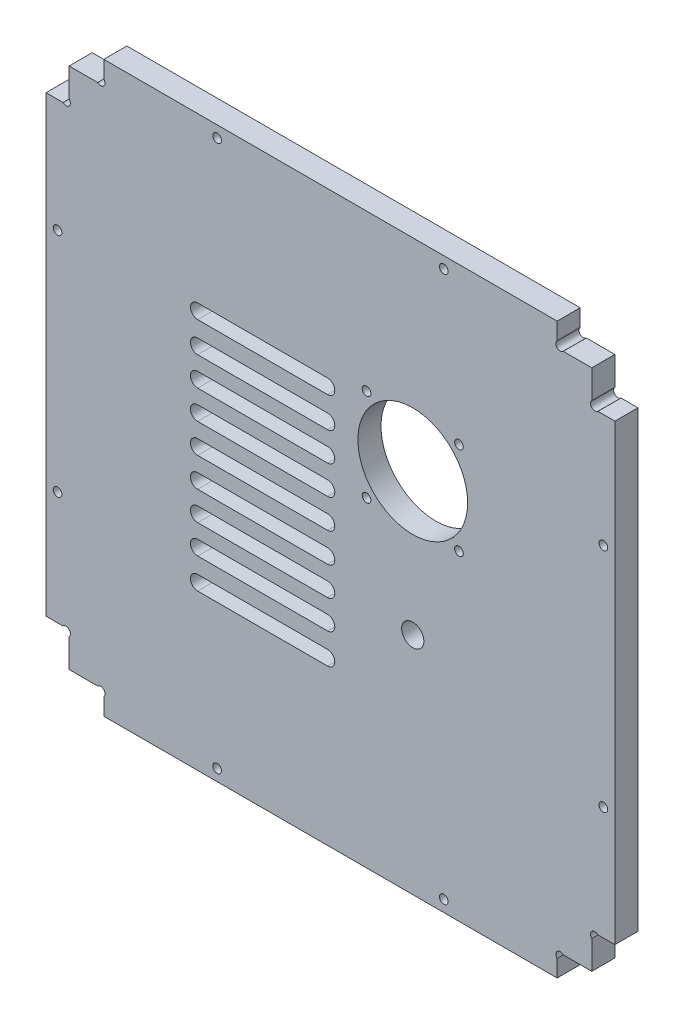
ISO-10303-21;
HEADER;
FILE_DESCRIPTION(('STEP AP214'),'2;1');
FILE_NAME('part.step','',(''),(''),'','','');
FILE_SCHEMA(('AUTOMOTIVE_DESIGN { 1 0 10303 214 1 1 1 1 }'));
ENDSEC;
DATA;
#1=APPLICATION_CONTEXT('core data for automotive mechanical design processes');
#2=APPLICATION_PROTOCOL_DEFINITION('international standard','automotive_design',2000,#1);
#3=PRODUCT_CONTEXT('',#1,'mechanical');
#4=PRODUCT('Part','Part','',(#3));
#5=PRODUCT_RELATED_PRODUCT_CATEGORY('part','',(#4));
#6=PRODUCT_DEFINITION_FORMATION('','',#4);
#7=PRODUCT_DEFINITION_CONTEXT('part definition',#1,'design');
#8=PRODUCT_DEFINITION('design','',#6,#7);
#9=PRODUCT_DEFINITION_SHAPE('','',#8);
#10=(LENGTH_UNIT() NAMED_UNIT(*) SI_UNIT(.MILLI.,.METRE.));
#11=(NAMED_UNIT(*) PLANE_ANGLE_UNIT() SI_UNIT($,.RADIAN.));
#12=(NAMED_UNIT(*) SI_UNIT($,.STERADIAN.) SOLID_ANGLE_UNIT());
#13=UNCERTAINTY_MEASURE_WITH_UNIT(LENGTH_MEASURE(1.E-05),#10,'distance_accuracy_value','');
#14=(GEOMETRIC_REPRESENTATION_CONTEXT(3) GLOBAL_UNCERTAINTY_ASSIGNED_CONTEXT((#13)) GLOBAL_UNIT_ASSIGNED_CONTEXT((#10,
#11,#12)) REPRESENTATION_CONTEXT('',''));
#15=CARTESIAN_POINT('',(0.,0.,0.));
#16=DIRECTION('',(0.,0.,1.));
#17=DIRECTION('',(1.,0.,0.));
#18=AXIS2_PLACEMENT_3D('',#15,#16,#17);
#19=CARTESIAN_POINT('',(-120.971294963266,23.5448793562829,8.));
#20=DIRECTION('',(0.,0.,1.));
#21=DIRECTION('',(1.,0.,0.));
#22=AXIS2_PLACEMENT_3D('',#19,#20,#21);
#23=PLANE('',#22);
#24=CARTESIAN_POINT('',(-246.531955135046,-69.5157807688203,8.));
#25=DIRECTION('',(0.,0.,1.));
#26=DIRECTION('',(1.,0.,0.));
#27=AXIS2_PLACEMENT_3D('',#24,#25,#26);
#28=CIRCLE('',#27,2.50000000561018);
#29=CARTESIAN_POINT('',(-246.531955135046,-67.0157807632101,8.));
#30=VERTEX_POINT('',#29);
#31=CARTESIAN_POINT('',(-246.531955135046,-72.0157807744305,8.));
#32=VERTEX_POINT('',#31);
#33=EDGE_CURVE('E48',#30,#32,#28,.T.);
#34=ORIENTED_EDGE('',*,*,#33,.F.);
#35=DIRECTION('',(-1.,0.,0.));
#36=VECTOR('',#35,1.);
#37=CARTESIAN_POINT('',(-246.531955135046,-67.0157807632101,8.));
#38=LINE('',#37,#36);
#39=CARTESIAN_POINT('',(-201.531955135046,-67.0157807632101,8.));
#40=VERTEX_POINT('',#39);
#41=EDGE_CURVE('E452',#40,#30,#38,.T.);
#42=ORIENTED_EDGE('',*,*,#41,.F.);
#43=CARTESIAN_POINT('',(-201.531955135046,-69.5157807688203,8.));
#44=DIRECTION('',(0.,0.,1.));
#45=DIRECTION('',(1.,0.,0.));
#46=AXIS2_PLACEMENT_3D('',#43,#44,#45);
#47=CIRCLE('',#46,2.50000000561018);
#48=CARTESIAN_POINT('',(-201.531955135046,-72.0157807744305,8.));
#49=VERTEX_POINT('',#48);
#50=EDGE_CURVE('E455',#49,#40,#47,.T.);
#51=ORIENTED_EDGE('',*,*,#50,.F.);
#52=DIRECTION('',(1.,0.,0.));
#53=VECTOR('',#52,1.);
#54=CARTESIAN_POINT('',(-246.531955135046,-72.0157807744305,8.));
#55=LINE('',#54,#53);
#56=EDGE_CURVE('E464',#32,#49,#55,.T.);
#57=ORIENTED_EDGE('',*,*,#56,.F.);
#58=EDGE_LOOP('',(#34,#42,#51,#57));
#59=FACE_BOUND('',#58,.T.);
#60=CARTESIAN_POINT('',(-246.531955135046,-39.3357807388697,8.));
#61=DIRECTION('',(0.,0.,1.));
#62=DIRECTION('',(-1.,0.,0.));
#63=AXIS2_PLACEMENT_3D('',#60,#61,#62);
#64=CIRCLE('',#63,2.5);
#65=CARTESIAN_POINT('',(-246.531955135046,-36.8357807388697,8.));
#66=VERTEX_POINT('',#65);
#67=CARTESIAN_POINT('',(-246.531955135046,-41.8357807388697,8.));
#68=VERTEX_POINT('',#67);
#69=EDGE_CURVE('E471',#66,#68,#64,.T.);
#70=ORIENTED_EDGE('',*,*,#69,.F.);
#71=DIRECTION('',(-1.,0.,0.));
#72=VECTOR('',#71,1.);
#73=CARTESIAN_POINT('',(-246.531955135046,-36.8357807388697,8.));
#74=LINE('',#73,#72);
#75=CARTESIAN_POINT('',(-201.531955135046,-36.8357807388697,8.));
#76=VERTEX_POINT('',#75);
#77=EDGE_CURVE('E479',#76,#66,#74,.T.);
#78=ORIENTED_EDGE('',*,*,#77,.F.);
#79=CARTESIAN_POINT('',(-201.531955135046,-39.3357807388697,8.));
#80=DIRECTION('',(0.,0.,1.));
#81=DIRECTION('',(-1.,0.,0.));
#82=AXIS2_PLACEMENT_3D('',#79,#80,#81);
#83=CIRCLE('',#82,2.5);
#84=CARTESIAN_POINT('',(-201.531955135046,-41.8357807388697,8.));
#85=VERTEX_POINT('',#84);
#86=EDGE_CURVE('E493',#85,#76,#83,.T.);
#87=ORIENTED_EDGE('',*,*,#86,.F.);
#88=DIRECTION('',(1.,0.,0.));
#89=VECTOR('',#88,1.);
#90=CARTESIAN_POINT('',(-246.531955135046,-41.8357807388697,8.));
#91=LINE('',#90,#89);
#92=EDGE_CURVE('E490',#68,#85,#91,.T.);
#93=ORIENTED_EDGE('',*,*,#92,.F.);
#94=EDGE_LOOP('',(#70,#78,#87,#93));
#95=FACE_BOUND('',#94,.T.);
#96=CARTESIAN_POINT('',(-246.531955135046,-49.3357807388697,8.));
#97=DIRECTION('',(0.,0.,1.));
#98=DIRECTION('',(-1.,0.,0.));
#99=AXIS2_PLACEMENT_3D('',#96,#97,#98);
#100=CIRCLE('',#99,2.5);
#101=CARTESIAN_POINT('',(-246.531955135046,-46.8357807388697,8.));
#102=VERTEX_POINT('',#101);
#103=CARTESIAN_POINT('',(-246.531955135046,-51.8357807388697,8.));
#104=VERTEX_POINT('',#103);
#105=EDGE_CURVE('E500',#102,#104,#100,.T.);
#106=ORIENTED_EDGE('',*,*,#105,.F.);
#107=DIRECTION('',(-1.,0.,0.));
#108=VECTOR('',#107,1.);
#109=CARTESIAN_POINT('',(-246.531955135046,-46.8357807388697,8.));
#110=LINE('',#109,#108);
#111=CARTESIAN_POINT('',(-201.531955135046,-46.8357807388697,8.));
#112=VERTEX_POINT('',#111);
#113=EDGE_CURVE('E511',#112,#102,#110,.T.);
#114=ORIENTED_EDGE('',*,*,#113,.F.);
#115=CARTESIAN_POINT('',(-201.531955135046,-49.3357807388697,8.));
#116=DIRECTION('',(0.,0.,1.));
#117=DIRECTION('',(-1.,0.,0.));
#118=AXIS2_PLACEMENT_3D('',#115,#116,#117);
#119=CIRCLE('',#118,2.5);
#120=CARTESIAN_POINT('',(-201.531955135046,-51.8357807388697,8.));
#121=VERTEX_POINT('',#120);
#122=EDGE_CURVE('E525',#121,#112,#119,.T.);
#123=ORIENTED_EDGE('',*,*,#122,.F.);
#124=DIRECTION('',(1.,0.,0.));
#125=VECTOR('',#124,1.);
#126=CARTESIAN_POINT('',(-246.531955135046,-51.8357807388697,8.));
#127=LINE('',#126,#125);
#128=EDGE_CURVE('E522',#104,#121,#127,.T.);
#129=ORIENTED_EDGE('',*,*,#128,.F.);
#130=EDGE_LOOP('',(#106,#114,#123,#129));
#131=FACE_BOUND('',#130,.T.);
#132=CARTESIAN_POINT('',(-246.531955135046,-59.3357807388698,8.));
#133=DIRECTION('',(0.,0.,1.));
#134=DIRECTION('',(-1.,0.,0.));
#135=AXIS2_PLACEMENT_3D('',#132,#133,#134);
#136=CIRCLE('',#135,2.50000000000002);
#137=CARTESIAN_POINT('',(-246.531955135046,-56.8357807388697,8.));
#138=VERTEX_POINT('',#137);
#139=CARTESIAN_POINT('',(-246.531955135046,-61.8357807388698,8.));
#140=VERTEX_POINT('',#139);
#141=EDGE_CURVE('E532',#138,#140,#136,.T.);
#142=ORIENTED_EDGE('',*,*,#141,.F.);
#143=DIRECTION('',(-1.,0.,0.));
#144=VECTOR('',#143,1.);
#145=CARTESIAN_POINT('',(-246.531955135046,-56.8357807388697,8.));
#146=LINE('',#145,#144);
#147=CARTESIAN_POINT('',(-201.531955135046,-56.8357807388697,8.));
#148=VERTEX_POINT('',#147);
#149=EDGE_CURVE('E543',#148,#138,#146,.T.);
#150=ORIENTED_EDGE('',*,*,#149,.F.);
#151=CARTESIAN_POINT('',(-201.531955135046,-59.3357807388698,8.));
#152=DIRECTION('',(0.,0.,1.));
#153=DIRECTION('',(-1.,0.,0.));
#154=AXIS2_PLACEMENT_3D('',#151,#152,#153);
#155=CIRCLE('',#154,2.50000000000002);
#156=CARTESIAN_POINT('',(-201.531955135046,-61.8357807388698,8.));
#157=VERTEX_POINT('',#156);
#158=EDGE_CURVE('E557',#157,#148,#155,.T.);
#159=ORIENTED_EDGE('',*,*,#158,.F.);
#160=DIRECTION('',(1.,0.,0.));
#161=VECTOR('',#160,1.);
#162=CARTESIAN_POINT('',(-246.531955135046,-61.8357807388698,8.));
#163=LINE('',#162,#161);
#164=EDGE_CURVE('E554',#140,#157,#163,.T.);
#165=ORIENTED_EDGE('',*,*,#164,.F.);
#166=EDGE_LOOP('',(#142,#150,#159,#165));
#167=FACE_BOUND('',#166,.T.);
#168=CARTESIAN_POINT('',(-246.531955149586,-28.8157807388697,8.));
#169=DIRECTION('',(0.,0.,1.));
#170=DIRECTION('',(-1.,0.,0.));
#171=AXIS2_PLACEMENT_3D('',#168,#169,#170);
#172=CIRCLE('',#171,2.5);
#173=CARTESIAN_POINT('',(-246.531955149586,-26.3157807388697,8.));
#174=VERTEX_POINT('',#173);
#175=CARTESIAN_POINT('',(-246.531955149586,-31.3157807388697,8.));
#176=VERTEX_POINT('',#175);
#177=EDGE_CURVE('E564',#174,#176,#172,.T.);
#178=ORIENTED_EDGE('',*,*,#177,.F.);
#179=DIRECTION('',(-1.,0.,0.));
#180=VECTOR('',#179,1.);
#181=CARTESIAN_POINT('',(-246.531955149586,-26.3157807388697,8.));
#182=LINE('',#181,#180);
#183=CARTESIAN_POINT('',(-201.531955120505,-26.3157807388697,8.));
#184=VERTEX_POINT('',#183);
#185=EDGE_CURVE('E575',#184,#174,#182,.T.);
#186=ORIENTED_EDGE('',*,*,#185,.F.);
#187=CARTESIAN_POINT('',(-201.531955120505,-28.8157807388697,8.));
#188=DIRECTION('',(0.,0.,1.));
#189=DIRECTION('',(-1.,0.,0.));
#190=AXIS2_PLACEMENT_3D('',#187,#188,#189);
#191=CIRCLE('',#190,2.5);
#192=CARTESIAN_POINT('',(-201.531955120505,-31.3157807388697,8.));
#193=VERTEX_POINT('',#192);
#194=EDGE_CURVE('E589',#193,#184,#191,.T.);
#195=ORIENTED_EDGE('',*,*,#194,.F.);
#196=DIRECTION('',(1.,0.,0.));
#197=VECTOR('',#196,1.);
#198=CARTESIAN_POINT('',(-246.531955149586,-31.3157807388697,8.));
#199=LINE('',#198,#197);
#200=EDGE_CURVE('E586',#176,#193,#199,.T.);
#201=ORIENTED_EDGE('',*,*,#200,.F.);
#202=EDGE_LOOP('',(#178,#186,#195,#201));
#203=FACE_BOUND('',#202,.T.);
#204=CARTESIAN_POINT('',(-246.531955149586,-110.215780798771,8.));
#205=DIRECTION('',(0.,0.,1.));
#206=DIRECTION('',(1.,0.,0.));
#207=AXIS2_PLACEMENT_3D('',#204,#205,#206);
#208=CIRCLE('',#207,2.5);
#209=CARTESIAN_POINT('',(-246.531955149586,-107.715780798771,8.));
#210=VERTEX_POINT('',#209);
#211=CARTESIAN_POINT('',(-246.531955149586,-112.715780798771,8.));
#212=VERTEX_POINT('',#211);
#213=EDGE_CURVE('E596',#210,#212,#208,.T.);
#214=ORIENTED_EDGE('',*,*,#213,.F.);
#215=DIRECTION('',(-1.,0.,0.));
#216=VECTOR('',#215,1.);
#217=CARTESIAN_POINT('',(-246.531955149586,-107.715780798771,8.));
#218=LINE('',#217,#216);
#219=CARTESIAN_POINT('',(-201.531955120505,-107.715780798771,8.));
#220=VERTEX_POINT('',#219);
#221=EDGE_CURVE('E607',#220,#210,#218,.T.);
#222=ORIENTED_EDGE('',*,*,#221,.F.);
#223=CARTESIAN_POINT('',(-201.531955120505,-110.215780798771,8.));
#224=DIRECTION('',(0.,0.,1.));
#225=DIRECTION('',(1.,0.,0.));
#226=AXIS2_PLACEMENT_3D('',#223,#224,#225);
#227=CIRCLE('',#226,2.5);
#228=CARTESIAN_POINT('',(-201.531955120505,-112.715780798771,8.));
#229=VERTEX_POINT('',#228);
#230=EDGE_CURVE('E621',#229,#220,#227,.T.);
#231=ORIENTED_EDGE('',*,*,#230,.F.);
#232=DIRECTION('',(1.,0.,0.));
#233=VECTOR('',#232,1.);
#234=CARTESIAN_POINT('',(-246.531955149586,-112.715780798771,8.));
#235=LINE('',#234,#233);
#236=EDGE_CURVE('E618',#212,#229,#235,.T.);
#237=ORIENTED_EDGE('',*,*,#236,.F.);
#238=EDGE_LOOP('',(#214,#222,#231,#237));
#239=FACE_BOUND('',#238,.T.);
#240=CARTESIAN_POINT('',(-246.531955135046,-79.6957807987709,8.));
#241=DIRECTION('',(0.,0.,1.));
#242=DIRECTION('',(1.,0.,0.));
#243=AXIS2_PLACEMENT_3D('',#240,#241,#242);
#244=CIRCLE('',#243,2.50000000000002);
#245=CARTESIAN_POINT('',(-246.531955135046,-77.1957807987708,8.));
#246=VERTEX_POINT('',#245);
#247=CARTESIAN_POINT('',(-246.531955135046,-82.1957807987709,8.));
#248=VERTEX_POINT('',#247);
#249=EDGE_CURVE('E628',#246,#248,#244,.T.);
#250=ORIENTED_EDGE('',*,*,#249,.F.);
#251=DIRECTION('',(-1.,0.,0.));
#252=VECTOR('',#251,1.);
#253=CARTESIAN_POINT('',(-246.531955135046,-77.1957807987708,8.));
#254=LINE('',#253,#252);
#255=CARTESIAN_POINT('',(-201.531955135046,-77.1957807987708,8.));
#256=VERTEX_POINT('',#255);
#257=EDGE_CURVE('E639',#256,#246,#254,.T.);
#258=ORIENTED_EDGE('',*,*,#257,.F.);
#259=CARTESIAN_POINT('',(-201.531955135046,-79.6957807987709,8.));
#260=DIRECTION('',(0.,0.,1.));
#261=DIRECTION('',(1.,0.,0.));
#262=AXIS2_PLACEMENT_3D('',#259,#260,#261);
#263=CIRCLE('',#262,2.50000000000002);
#264=CARTESIAN_POINT('',(-201.531955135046,-82.1957807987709,8.));
#265=VERTEX_POINT('',#264);
#266=EDGE_CURVE('E653',#265,#256,#263,.T.);
#267=ORIENTED_EDGE('',*,*,#266,.F.);
#268=DIRECTION('',(1.,0.,0.));
#269=VECTOR('',#268,1.);
#270=CARTESIAN_POINT('',(-246.531955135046,-82.1957807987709,8.));
#271=LINE('',#270,#269);
#272=EDGE_CURVE('E650',#248,#265,#271,.T.);
#273=ORIENTED_EDGE('',*,*,#272,.F.);
#274=EDGE_LOOP('',(#250,#258,#267,#273));
#275=FACE_BOUND('',#274,.T.);
#276=CARTESIAN_POINT('',(-246.531955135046,-89.6957807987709,8.));
#277=DIRECTION('',(0.,0.,1.));
#278=DIRECTION('',(1.,0.,0.));
#279=AXIS2_PLACEMENT_3D('',#276,#277,#278);
#280=CIRCLE('',#279,2.5);
#281=CARTESIAN_POINT('',(-246.531955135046,-87.1957807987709,8.));
#282=VERTEX_POINT('',#281);
#283=CARTESIAN_POINT('',(-246.531955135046,-92.1957807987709,8.));
#284=VERTEX_POINT('',#283);
#285=EDGE_CURVE('E660',#282,#284,#280,.T.);
#286=ORIENTED_EDGE('',*,*,#285,.F.);
#287=DIRECTION('',(-1.,0.,0.));
#288=VECTOR('',#287,1.);
#289=CARTESIAN_POINT('',(-246.531955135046,-87.1957807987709,8.));
#290=LINE('',#289,#288);
#291=CARTESIAN_POINT('',(-201.531955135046,-87.1957807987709,8.));
#292=VERTEX_POINT('',#291);
#293=EDGE_CURVE('E671',#292,#282,#290,.T.);
#294=ORIENTED_EDGE('',*,*,#293,.F.);
#295=CARTESIAN_POINT('',(-201.531955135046,-89.6957807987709,8.));
#296=DIRECTION('',(0.,0.,1.));
#297=DIRECTION('',(1.,0.,0.));
#298=AXIS2_PLACEMENT_3D('',#295,#296,#297);
#299=CIRCLE('',#298,2.5);
#300=CARTESIAN_POINT('',(-201.531955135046,-92.1957807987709,8.));
#301=VERTEX_POINT('',#300);
#302=EDGE_CURVE('E685',#301,#292,#299,.T.);
#303=ORIENTED_EDGE('',*,*,#302,.F.);
#304=DIRECTION('',(1.,0.,0.));
#305=VECTOR('',#304,1.);
#306=CARTESIAN_POINT('',(-246.531955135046,-92.1957807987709,8.));
#307=LINE('',#306,#305);
#308=EDGE_CURVE('E682',#284,#301,#307,.T.);
#309=ORIENTED_EDGE('',*,*,#308,.F.);
#310=EDGE_LOOP('',(#286,#294,#303,#309));
#311=FACE_BOUND('',#310,.T.);
#312=CARTESIAN_POINT('',(-246.531955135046,-99.6957807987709,8.));
#313=DIRECTION('',(0.,0.,1.));
#314=DIRECTION('',(1.,0.,0.));
#315=AXIS2_PLACEMENT_3D('',#312,#313,#314);
#316=CIRCLE('',#315,2.5);
#317=CARTESIAN_POINT('',(-246.531955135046,-97.1957807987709,8.));
#318=VERTEX_POINT('',#317);
#319=CARTESIAN_POINT('',(-246.531955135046,-102.195780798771,8.));
#320=VERTEX_POINT('',#319);
#321=EDGE_CURVE('E692',#318,#320,#316,.T.);
#322=ORIENTED_EDGE('',*,*,#321,.F.);
#323=DIRECTION('',(-1.,0.,0.));
#324=VECTOR('',#323,1.);
#325=CARTESIAN_POINT('',(-246.531955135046,-97.1957807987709,8.));
#326=LINE('',#325,#324);
#327=CARTESIAN_POINT('',(-201.531955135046,-97.1957807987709,8.));
#328=VERTEX_POINT('',#327);
#329=EDGE_CURVE('E703',#328,#318,#326,.T.);
#330=ORIENTED_EDGE('',*,*,#329,.F.);
#331=CARTESIAN_POINT('',(-201.531955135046,-99.6957807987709,8.));
#332=DIRECTION('',(0.,0.,1.));
#333=DIRECTION('',(1.,0.,0.));
#334=AXIS2_PLACEMENT_3D('',#331,#332,#333);
#335=CIRCLE('',#334,2.5);
#336=CARTESIAN_POINT('',(-201.531955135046,-102.195780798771,8.));
#337=VERTEX_POINT('',#336);
#338=EDGE_CURVE('E717',#337,#328,#335,.T.);
#339=ORIENTED_EDGE('',*,*,#338,.F.);
#340=DIRECTION('',(1.,0.,0.));
#341=VECTOR('',#340,1.);
#342=CARTESIAN_POINT('',(-246.531955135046,-102.195780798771,8.));
#343=LINE('',#342,#341);
#344=EDGE_CURVE('E714',#320,#337,#343,.T.);
#345=ORIENTED_EDGE('',*,*,#344,.F.);
#346=EDGE_LOOP('',(#322,#330,#339,#345));
#347=FACE_BOUND('',#346,.T.);
#348=CARTESIAN_POINT('',(-172.031955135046,-88.6157808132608,8.));
#349=DIRECTION('',(0.,0.,1.));
#350=DIRECTION('',(1.,0.,0.));
#351=AXIS2_PLACEMENT_3D('',#348,#349,#350);
#352=CIRCLE('',#351,3.85);
#353=CARTESIAN_POINT('',(-168.181955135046,-88.6157808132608,8.));
#354=VERTEX_POINT('',#353);
#355=EDGE_CURVE('E724',#354,#354,#352,.T.);
#356=ORIENTED_EDGE('',*,*,#355,.F.);
#357=EDGE_LOOP('',(#356));
#358=FACE_BOUND('',#357,.T.);
#359=CARTESIAN_POINT('',(-188.031955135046,-23.5157807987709,8.));
#360=DIRECTION('',(0.,0.,1.));
#361=DIRECTION('',(1.,0.,0.));
#362=AXIS2_PLACEMENT_3D('',#359,#360,#361);
#363=CIRCLE('',#362,1.49999999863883);
#364=CARTESIAN_POINT('',(-186.531955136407,-23.5157807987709,8.));
#365=VERTEX_POINT('',#364);
#366=EDGE_CURVE('E734',#365,#365,#363,.T.);
#367=ORIENTED_EDGE('',*,*,#366,.F.);
#368=EDGE_LOOP('',(#367));
#369=FACE_BOUND('',#368,.T.);
#370=CARTESIAN_POINT('',(-156.031955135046,-23.5157807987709,8.));
#371=DIRECTION('',(0.,0.,1.));
#372=DIRECTION('',(1.,0.,0.));
#373=AXIS2_PLACEMENT_3D('',#370,#371,#372);
#374=CIRCLE('',#373,1.49999999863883);
#375=CARTESIAN_POINT('',(-154.531955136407,-23.5157807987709,8.));
#376=VERTEX_POINT('',#375);
#377=EDGE_CURVE('E740',#376,#376,#374,.T.);
#378=ORIENTED_EDGE('',*,*,#377,.F.);
#379=EDGE_LOOP('',(#378));
#380=FACE_BOUND('',#379,.T.);
#381=CARTESIAN_POINT('',(-156.031955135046,-55.5157807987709,8.));
#382=DIRECTION('',(0.,0.,1.));
#383=DIRECTION('',(1.,0.,0.));
#384=AXIS2_PLACEMENT_3D('',#381,#382,#383);
#385=CIRCLE('',#384,1.49999999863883);
#386=CARTESIAN_POINT('',(-154.531955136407,-55.5157807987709,8.));
#387=VERTEX_POINT('',#386);
#388=EDGE_CURVE('E746',#387,#387,#385,.T.);
#389=ORIENTED_EDGE('',*,*,#388,.F.);
#390=EDGE_LOOP('',(#389));
#391=FACE_BOUND('',#390,.T.);
#392=CARTESIAN_POINT('',(-188.031955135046,-55.5157807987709,8.));
#393=DIRECTION('',(0.,0.,1.));
#394=DIRECTION('',(1.,0.,0.));
#395=AXIS2_PLACEMENT_3D('',#392,#393,#394);
#396=CIRCLE('',#395,1.49999999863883);
#397=CARTESIAN_POINT('',(-186.531955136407,-55.5157807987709,8.));
#398=VERTEX_POINT('',#397);
#399=EDGE_CURVE('E752',#398,#398,#396,.T.);
#400=ORIENTED_EDGE('',*,*,#399,.F.);
#401=EDGE_LOOP('',(#400));
#402=FACE_BOUND('',#401,.T.);
#403=CARTESIAN_POINT('',(-172.031955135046,-39.5157807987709,8.));
#404=DIRECTION('',(0.,0.,1.));
#405=DIRECTION('',(1.,0.,0.));
#406=AXIS2_PLACEMENT_3D('',#403,#404,#405);
#407=CIRCLE('',#406,18.9999999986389);
#408=CARTESIAN_POINT('',(-153.031955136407,-39.5157807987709,8.));
#409=VERTEX_POINT('',#408);
#410=EDGE_CURVE('E758',#409,#409,#407,.T.);
#411=ORIENTED_EDGE('',*,*,#410,.F.);
#412=EDGE_LOOP('',(#411));
#413=FACE_BOUND('',#412,.T.);
#414=CARTESIAN_POINT('',(-239.781955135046,26.4842191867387,8.));
#415=DIRECTION('',(0.,0.,1.));
#416=DIRECTION('',(1.,0.,0.));
#417=AXIS2_PLACEMENT_3D('',#414,#415,#416);
#418=CIRCLE('',#417,1.5);
#419=CARTESIAN_POINT('',(-238.281955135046,26.4842191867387,8.));
#420=VERTEX_POINT('',#419);
#421=EDGE_CURVE('E773',#420,#420,#418,.T.);
#422=ORIENTED_EDGE('',*,*,#421,.F.);
#423=EDGE_LOOP('',(#422));
#424=FACE_BOUND('',#423,.T.);
#425=CARTESIAN_POINT('',(-106.031955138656,-28.7657808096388,8.));
#426=DIRECTION('',(0.,0.,1.));
#427=DIRECTION('',(1.,0.,0.));
#428=AXIS2_PLACEMENT_3D('',#425,#426,#427);
#429=CIRCLE('',#428,1.5);
#430=CARTESIAN_POINT('',(-104.531955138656,-28.7657808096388,8.));
#431=VERTEX_POINT('',#430);
#432=EDGE_CURVE('E785',#431,#431,#429,.T.);
#433=ORIENTED_EDGE('',*,*,#432,.F.);
#434=EDGE_LOOP('',(#433));
#435=FACE_BOUND('',#434,.T.);
#436=CARTESIAN_POINT('',(-161.281955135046,-162.515780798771,8.));
#437=DIRECTION('',(0.,0.,1.));
#438=DIRECTION('',(1.,0.,0.));
#439=AXIS2_PLACEMENT_3D('',#436,#437,#438);
#440=CIRCLE('',#439,1.5);
#441=CARTESIAN_POINT('',(-159.781955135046,-162.515780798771,8.));
#442=VERTEX_POINT('',#441);
#443=EDGE_CURVE('E797',#442,#442,#440,.T.);
#444=ORIENTED_EDGE('',*,*,#443,.F.);
#445=EDGE_LOOP('',(#444));
#446=FACE_BOUND('',#445,.T.);
#447=CARTESIAN_POINT('',(-295.031955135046,-107.265780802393,8.));
#448=DIRECTION('',(0.,0.,1.));
#449=DIRECTION('',(1.,0.,0.));
#450=AXIS2_PLACEMENT_3D('',#447,#448,#449);
#451=CIRCLE('',#450,1.50000000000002);
#452=CARTESIAN_POINT('',(-293.531955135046,-107.265780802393,8.));
#453=VERTEX_POINT('',#452);
#454=EDGE_CURVE('E809',#453,#453,#451,.T.);
#455=ORIENTED_EDGE('',*,*,#454,.F.);
#456=EDGE_LOOP('',(#455));
#457=FACE_BOUND('',#456,.T.);
#458=DIRECTION('',(0.,1.,0.));
#459=VECTOR('',#458,1.);
#460=CARTESIAN_POINT('',(-122.031955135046,30.4842191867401,8.));
#461=LINE('',#460,#459);
#462=CARTESIAN_POINT('',(-122.031955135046,24.6055395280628,8.));
#463=VERTEX_POINT('',#462);
#464=CARTESIAN_POINT('',(-122.031955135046,30.4842191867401,8.));
#465=VERTEX_POINT('',#464);
#466=EDGE_CURVE('E815',#463,#465,#461,.T.);
#467=ORIENTED_EDGE('',*,*,#466,.T.);
#468=DIRECTION('',(-1.,0.,0.));
#469=VECTOR('',#468,1.);
#470=CARTESIAN_POINT('',(-279.031955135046,30.4842191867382,8.));
#471=LINE('',#470,#469);
#472=CARTESIAN_POINT('',(-279.031955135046,30.4842191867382,8.));
#473=VERTEX_POINT('',#472);
#474=EDGE_CURVE('E818',#465,#473,#471,.T.);
#475=ORIENTED_EDGE('',*,*,#474,.T.);
#476=DIRECTION('',(0.,-1.,0.));
#477=VECTOR('',#476,1.);
#478=CARTESIAN_POINT('',(-279.031955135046,30.4842191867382,8.));
#479=LINE('',#478,#477);
#480=CARTESIAN_POINT('',(-279.031955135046,24.6055395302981,8.));
#481=VERTEX_POINT('',#480);
#482=EDGE_CURVE('E821',#473,#481,#479,.T.);
#483=ORIENTED_EDGE('',*,*,#482,.T.);
#484=CARTESIAN_POINT('',(-280.092615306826,23.5448793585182,8.));
#485=DIRECTION('',(0.,0.,-1.));
#486=DIRECTION('',(1.,0.,0.));
#487=AXIS2_PLACEMENT_3D('',#484,#485,#486);
#488=CIRCLE('',#487,1.50000000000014);
#489=CARTESIAN_POINT('',(-281.153275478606,22.4842191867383,8.));
#490=VERTEX_POINT('',#489);
#491=EDGE_CURVE('E823',#481,#490,#488,.T.);
#492=ORIENTED_EDGE('',*,*,#491,.T.);
#493=DIRECTION('',(-1.,0.,0.));
#494=VECTOR('',#493,1.);
#495=CARTESIAN_POINT('',(-281.153275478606,22.4842191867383,8.));
#496=LINE('',#495,#494);
#497=CARTESIAN_POINT('',(-291.031955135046,22.4842191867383,8.));
#498=VERTEX_POINT('',#497);
#499=EDGE_CURVE('E825',#490,#498,#496,.T.);
#500=ORIENTED_EDGE('',*,*,#499,.T.);
#501=DIRECTION('',(0.,-1.,0.));
#502=VECTOR('',#501,1.);
#503=CARTESIAN_POINT('',(-291.031955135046,22.4842191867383,8.));
#504=LINE('',#503,#502);
#505=CARTESIAN_POINT('',(-291.031955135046,12.6055395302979,8.));
#506=VERTEX_POINT('',#505);
#507=EDGE_CURVE('E827',#498,#506,#504,.T.);
#508=ORIENTED_EDGE('',*,*,#507,.T.);
#509=CARTESIAN_POINT('',(-292.092615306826,11.5448793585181,8.));
#510=DIRECTION('',(0.,0.,-1.));
#511=DIRECTION('',(1.,0.,0.));
#512=AXIS2_PLACEMENT_3D('',#509,#510,#511);
#513=CIRCLE('',#512,1.50000000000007);
#514=CARTESIAN_POINT('',(-293.153275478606,10.4842191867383,8.));
#515=VERTEX_POINT('',#514);
#516=EDGE_CURVE('E829',#506,#515,#513,.T.);
#517=ORIENTED_EDGE('',*,*,#516,.T.);
#518=DIRECTION('',(-1.,0.,0.));
#519=VECTOR('',#518,1.);
#520=CARTESIAN_POINT('',(-293.153275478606,10.4842191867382,8.));
#521=LINE('',#520,#519);
#522=CARTESIAN_POINT('',(-299.031955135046,10.4842191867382,8.));
#523=VERTEX_POINT('',#522);
#524=EDGE_CURVE('E831',#515,#523,#521,.T.);
#525=ORIENTED_EDGE('',*,*,#524,.T.);
#526=DIRECTION('',(0.,-1.,0.));
#527=VECTOR('',#526,1.);
#528=CARTESIAN_POINT('',(-299.031955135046,10.4842191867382,8.));
#529=LINE('',#528,#527);
#530=CARTESIAN_POINT('',(-299.031955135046,-146.515780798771,8.));
#531=VERTEX_POINT('',#530);
#532=EDGE_CURVE('E833',#523,#531,#529,.T.);
#533=ORIENTED_EDGE('',*,*,#532,.T.);
#534=DIRECTION('',(1.,0.,0.));
#535=VECTOR('',#534,1.);
#536=CARTESIAN_POINT('',(-299.031955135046,-146.515780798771,8.));
#537=LINE('',#536,#535);
#538=CARTESIAN_POINT('',(-293.153275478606,-146.515780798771,8.));
#539=VERTEX_POINT('',#538);
#540=EDGE_CURVE('E835',#531,#539,#537,.T.);
#541=ORIENTED_EDGE('',*,*,#540,.T.);
#542=CARTESIAN_POINT('',(-292.092615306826,-147.576440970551,8.));
#543=DIRECTION('',(0.,0.,-1.));
#544=DIRECTION('',(1.,0.,0.));
#545=AXIS2_PLACEMENT_3D('',#542,#543,#544);
#546=CIRCLE('',#545,1.49999999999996);
#547=CARTESIAN_POINT('',(-291.031955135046,-148.63710114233,8.));
#548=VERTEX_POINT('',#547);
#549=EDGE_CURVE('E837',#539,#548,#546,.T.);
#550=ORIENTED_EDGE('',*,*,#549,.T.);
#551=DIRECTION('',(0.,-1.,0.));
#552=VECTOR('',#551,1.);
#553=CARTESIAN_POINT('',(-291.031955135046,-148.63710114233,8.));
#554=LINE('',#553,#552);
#555=CARTESIAN_POINT('',(-291.031955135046,-158.515780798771,8.));
#556=VERTEX_POINT('',#555);
#557=EDGE_CURVE('E839',#548,#556,#554,.T.);
#558=ORIENTED_EDGE('',*,*,#557,.T.);
#559=DIRECTION('',(1.,0.,0.));
#560=VECTOR('',#559,1.);
#561=CARTESIAN_POINT('',(-291.031955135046,-158.515780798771,8.));
#562=LINE('',#561,#560);
#563=CARTESIAN_POINT('',(-281.153275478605,-158.515780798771,8.));
#564=VERTEX_POINT('',#563);
#565=EDGE_CURVE('E841',#556,#564,#562,.T.);
#566=ORIENTED_EDGE('',*,*,#565,.T.);
#567=CARTESIAN_POINT('',(-280.092615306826,-159.576440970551,8.));
#568=DIRECTION('',(0.,0.,-1.));
#569=DIRECTION('',(1.,0.,0.));
#570=AXIS2_PLACEMENT_3D('',#567,#568,#569);
#571=CIRCLE('',#570,1.49999999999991);
#572=CARTESIAN_POINT('',(-279.031955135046,-160.63710114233,8.));
#573=VERTEX_POINT('',#572);
#574=EDGE_CURVE('E843',#564,#573,#571,.T.);
#575=ORIENTED_EDGE('',*,*,#574,.T.);
#576=DIRECTION('',(0.,-1.,0.));
#577=VECTOR('',#576,1.);
#578=CARTESIAN_POINT('',(-279.031955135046,-160.63710114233,8.));
#579=LINE('',#578,#577);
#580=CARTESIAN_POINT('',(-279.031955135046,-166.515780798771,8.));
#581=VERTEX_POINT('',#580);
#582=EDGE_CURVE('E845',#573,#581,#579,.T.);
#583=ORIENTED_EDGE('',*,*,#582,.T.);
#584=DIRECTION('',(1.,0.,0.));
#585=VECTOR('',#584,1.);
#586=CARTESIAN_POINT('',(-279.031955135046,-166.515780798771,8.));
#587=LINE('',#586,#585);
#588=CARTESIAN_POINT('',(-122.031955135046,-166.515780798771,8.));
#589=VERTEX_POINT('',#588);
#590=EDGE_CURVE('E847',#581,#589,#587,.T.);
#591=ORIENTED_EDGE('',*,*,#590,.T.);
#592=DIRECTION('',(0.,1.,0.));
#593=VECTOR('',#592,1.);
#594=CARTESIAN_POINT('',(-122.031955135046,-160.63710114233,8.));
#595=LINE('',#594,#593);
#596=CARTESIAN_POINT('',(-122.031955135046,-160.63710114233,8.));
#597=VERTEX_POINT('',#596);
#598=EDGE_CURVE('E849',#589,#597,#595,.T.);
#599=ORIENTED_EDGE('',*,*,#598,.T.);
#600=CARTESIAN_POINT('',(-120.971294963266,-159.576440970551,8.));
#601=DIRECTION('',(0.,0.,-1.));
#602=DIRECTION('',(1.,0.,0.));
#603=AXIS2_PLACEMENT_3D('',#600,#601,#602);
#604=CIRCLE('',#603,1.49999999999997);
#605=CARTESIAN_POINT('',(-119.910634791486,-158.515780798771,8.));
#606=VERTEX_POINT('',#605);
#607=EDGE_CURVE('E851',#597,#606,#604,.T.);
#608=ORIENTED_EDGE('',*,*,#607,.T.);
#609=DIRECTION('',(1.,0.,0.));
#610=VECTOR('',#609,1.);
#611=CARTESIAN_POINT('',(-110.031955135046,-158.515780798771,8.));
#612=LINE('',#611,#610);
#613=CARTESIAN_POINT('',(-110.031955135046,-158.515780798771,8.));
#614=VERTEX_POINT('',#613);
#615=EDGE_CURVE('E853',#606,#614,#612,.T.);
#616=ORIENTED_EDGE('',*,*,#615,.T.);
#617=DIRECTION('',(0.,1.,0.));
#618=VECTOR('',#617,1.);
#619=CARTESIAN_POINT('',(-110.031955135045,-148.637101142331,8.));
#620=LINE('',#619,#618);
#621=CARTESIAN_POINT('',(-110.031955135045,-148.637101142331,8.));
#622=VERTEX_POINT('',#621);
#623=EDGE_CURVE('E855',#614,#622,#620,.T.);
#624=ORIENTED_EDGE('',*,*,#623,.T.);
#625=CARTESIAN_POINT('',(-108.971294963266,-147.576440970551,8.));
#626=DIRECTION('',(0.,0.,-1.));
#627=DIRECTION('',(1.,0.,0.));
#628=AXIS2_PLACEMENT_3D('',#625,#626,#627);
#629=CIRCLE('',#628,1.49999999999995);
#630=CARTESIAN_POINT('',(-107.910634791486,-146.515780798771,8.));
#631=VERTEX_POINT('',#630);
#632=EDGE_CURVE('E857',#622,#631,#629,.T.);
#633=ORIENTED_EDGE('',*,*,#632,.T.);
#634=DIRECTION('',(1.,0.,0.));
#635=VECTOR('',#634,1.);
#636=CARTESIAN_POINT('',(-102.031955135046,-146.515780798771,8.));
#637=LINE('',#636,#635);
#638=CARTESIAN_POINT('',(-102.031955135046,-146.515780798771,8.));
#639=VERTEX_POINT('',#638);
#640=EDGE_CURVE('E859',#631,#639,#637,.T.);
#641=ORIENTED_EDGE('',*,*,#640,.T.);
#642=DIRECTION('',(0.,1.,0.));
#643=VECTOR('',#642,1.);
#644=CARTESIAN_POINT('',(-102.031955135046,-89.5157807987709,8.));
#645=LINE('',#644,#643);
#646=CARTESIAN_POINT('',(-102.031955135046,10.4842191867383,8.));
#647=VERTEX_POINT('',#646);
#648=EDGE_CURVE('E861',#639,#647,#645,.T.);
#649=ORIENTED_EDGE('',*,*,#648,.T.);
#650=DIRECTION('',(-1.,0.,0.));
#651=VECTOR('',#650,1.);
#652=CARTESIAN_POINT('',(-107.910634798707,10.4842191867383,8.));
#653=LINE('',#652,#651);
#654=CARTESIAN_POINT('',(-107.910634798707,10.4842191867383,8.));
#655=VERTEX_POINT('',#654);
#656=EDGE_CURVE('E863',#647,#655,#653,.T.);
#657=ORIENTED_EDGE('',*,*,#656,.T.);
#658=CARTESIAN_POINT('',(-108.971294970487,11.5448793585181,8.));
#659=DIRECTION('',(0.,0.,-1.));
#660=DIRECTION('',(1.,0.,0.));
#661=AXIS2_PLACEMENT_3D('',#658,#659,#660);
#662=CIRCLE('',#661,1.49999999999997);
#663=CARTESIAN_POINT('',(-110.031955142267,12.6055395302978,8.));
#664=VERTEX_POINT('',#663);
#665=EDGE_CURVE('E865',#655,#664,#662,.T.);
#666=ORIENTED_EDGE('',*,*,#665,.T.);
#667=DIRECTION('',(0.,1.,0.));
#668=VECTOR('',#667,1.);
#669=CARTESIAN_POINT('',(-110.031955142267,22.4842191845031,8.));
#670=LINE('',#669,#668);
#671=CARTESIAN_POINT('',(-110.031955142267,22.4842191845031,8.));
#672=VERTEX_POINT('',#671);
#673=EDGE_CURVE('E867',#664,#672,#670,.T.);
#674=ORIENTED_EDGE('',*,*,#673,.T.);
#675=DIRECTION('',(-1.,0.,0.));
#676=VECTOR('',#675,1.);
#677=CARTESIAN_POINT('',(-119.910634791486,22.4842191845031,8.));
#678=LINE('',#677,#676);
#679=CARTESIAN_POINT('',(-119.910634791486,22.4842191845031,8.));
#680=VERTEX_POINT('',#679);
#681=EDGE_CURVE('E869',#672,#680,#678,.T.);
#682=ORIENTED_EDGE('',*,*,#681,.T.);
#683=CARTESIAN_POINT('',(-120.971294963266,23.5448793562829,8.));
#684=DIRECTION('',(0.,0.,-1.));
#685=DIRECTION('',(1.,0.,0.));
#686=AXIS2_PLACEMENT_3D('',#683,#684,#685);
#687=CIRCLE('',#686,1.50000000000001);
#688=EDGE_CURVE('E871',#680,#463,#687,.T.);
#689=ORIENTED_EDGE('',*,*,#688,.T.);
#690=EDGE_LOOP('',(#467,#475,#483,#492,#500,#508,#517,#525,#533,#541,#550,#558,#566,#575,#583,
#591,#599,#608,#616,#624,#633,#641,#649,#657,#666,#674,#682,#689));
#691=FACE_BOUND('',#690,.T.);
#692=CARTESIAN_POINT('',(-239.781955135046,-162.515780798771,8.));
#693=DIRECTION('',(0.,0.,1.));
#694=DIRECTION('',(1.,0.,0.));
#695=AXIS2_PLACEMENT_3D('',#692,#693,#694);
#696=CIRCLE('',#695,1.5);
#697=CARTESIAN_POINT('',(-238.281955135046,-162.515780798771,8.));
#698=VERTEX_POINT('',#697);
#699=EDGE_CURVE('E803',#698,#698,#696,.T.);
#700=ORIENTED_EDGE('',*,*,#699,.F.);
#701=EDGE_LOOP('',(#700));
#702=FACE_BOUND('',#701,.T.);
#703=CARTESIAN_POINT('',(-106.031955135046,-107.265780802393,8.));
#704=DIRECTION('',(0.,0.,1.));
#705=DIRECTION('',(1.,0.,0.));
#706=AXIS2_PLACEMENT_3D('',#703,#704,#705);
#707=CIRCLE('',#706,1.5);
#708=CARTESIAN_POINT('',(-104.531955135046,-107.265780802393,8.));
#709=VERTEX_POINT('',#708);
#710=EDGE_CURVE('E791',#709,#709,#707,.T.);
#711=ORIENTED_EDGE('',*,*,#710,.F.);
#712=EDGE_LOOP('',(#711));
#713=FACE_BOUND('',#712,.T.);
#714=CARTESIAN_POINT('',(-161.281955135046,26.4842191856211,8.));
#715=DIRECTION('',(0.,0.,1.));
#716=DIRECTION('',(1.,0.,0.));
#717=AXIS2_PLACEMENT_3D('',#714,#715,#716);
#718=CIRCLE('',#717,1.5);
#719=CARTESIAN_POINT('',(-159.781955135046,26.4842191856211,8.));
#720=VERTEX_POINT('',#719);
#721=EDGE_CURVE('E779',#720,#720,#718,.T.);
#722=ORIENTED_EDGE('',*,*,#721,.F.);
#723=EDGE_LOOP('',(#722));
#724=FACE_BOUND('',#723,.T.);
#725=CARTESIAN_POINT('',(-295.031955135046,-28.7657808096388,8.));
#726=DIRECTION('',(0.,0.,1.));
#727=DIRECTION('',(1.,0.,0.));
#728=AXIS2_PLACEMENT_3D('',#725,#726,#727);
#729=CIRCLE('',#728,1.50000000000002);
#730=CARTESIAN_POINT('',(-293.531955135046,-28.7657808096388,8.));
#731=VERTEX_POINT('',#730);
#732=EDGE_CURVE('E767',#731,#731,#729,.T.);
#733=ORIENTED_EDGE('',*,*,#732,.F.);
#734=EDGE_LOOP('',(#733));
#735=FACE_BOUND('',#734,.T.);
#736=ADVANCED_FACE('F33',(#59,#95,#131,#167,#203,#239,#275,#311,#347,#358,#369,#380,#391,#402,
#413,#424,#435,#446,#457,#691,#702,#713,#724,#735),#23,.T.);
#737=CARTESIAN_POINT('',(-120.971294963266,23.5448793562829,0.));
#738=DIRECTION('',(0.,0.,1.));
#739=DIRECTION('',(1.,0.,0.));
#740=AXIS2_PLACEMENT_3D('',#737,#738,#739);
#741=PLANE('',#740);
#742=CARTESIAN_POINT('',(-163.031955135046,-88.6157808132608,0.));
#743=DIRECTION('',(0.,0.,-1.));
#744=DIRECTION('',(-1.,0.,0.));
#745=AXIS2_PLACEMENT_3D('',#742,#743,#744);
#746=CIRCLE('',#745,0.999999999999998);
#747=CARTESIAN_POINT('',(-164.031955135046,-88.6157808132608,0.));
#748=VERTEX_POINT('',#747);
#749=EDGE_CURVE('E1953',#748,#748,#746,.T.);
#750=ORIENTED_EDGE('',*,*,#749,.F.);
#751=EDGE_LOOP('',(#750));
#752=FACE_BOUND('',#751,.T.);
#753=CARTESIAN_POINT('',(-172.031955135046,-79.6157808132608,0.));
#754=DIRECTION('',(0.,0.,-1.));
#755=DIRECTION('',(-1.,0.,0.));
#756=AXIS2_PLACEMENT_3D('',#753,#754,#755);
#757=CIRCLE('',#756,0.999999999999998);
#758=CARTESIAN_POINT('',(-173.031955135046,-79.6157808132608,0.));
#759=VERTEX_POINT('',#758);
#760=EDGE_CURVE('E1952',#759,#759,#757,.T.);
#761=ORIENTED_EDGE('',*,*,#760,.F.);
#762=EDGE_LOOP('',(#761));
#763=FACE_BOUND('',#762,.T.);
#764=CARTESIAN_POINT('',(-181.031955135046,-88.6157808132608,0.));
#765=DIRECTION('',(0.,0.,-1.));
#766=DIRECTION('',(-1.,0.,0.));
#767=AXIS2_PLACEMENT_3D('',#764,#765,#766);
#768=CIRCLE('',#767,0.999999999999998);
#769=CARTESIAN_POINT('',(-182.031955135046,-88.6157808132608,0.));
#770=VERTEX_POINT('',#769);
#771=EDGE_CURVE('E458',#770,#770,#768,.T.);
#772=ORIENTED_EDGE('',*,*,#771,.F.);
#773=EDGE_LOOP('',(#772));
#774=FACE_BOUND('',#773,.T.);
#775=DIRECTION('',(-1.,0.,0.));
#776=VECTOR('',#775,1.);
#777=CARTESIAN_POINT('',(-246.531955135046,-67.0157807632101,0.));
#778=LINE('',#777,#776);
#779=CARTESIAN_POINT('',(-201.531955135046,-67.0157807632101,0.));
#780=VERTEX_POINT('',#779);
#781=CARTESIAN_POINT('',(-246.531955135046,-67.0157807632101,0.));
#782=VERTEX_POINT('',#781);
#783=EDGE_CURVE('E442',#780,#782,#778,.T.);
#784=ORIENTED_EDGE('',*,*,#783,.T.);
#785=CARTESIAN_POINT('',(-246.531955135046,-69.5157807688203,0.));
#786=DIRECTION('',(0.,0.,1.));
#787=DIRECTION('',(1.,0.,0.));
#788=AXIS2_PLACEMENT_3D('',#785,#786,#787);
#789=CIRCLE('',#788,2.50000000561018);
#790=CARTESIAN_POINT('',(-246.531955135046,-72.0157807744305,0.));
#791=VERTEX_POINT('',#790);
#792=EDGE_CURVE('E436',#782,#791,#789,.T.);
#793=ORIENTED_EDGE('',*,*,#792,.T.);
#794=DIRECTION('',(1.,0.,0.));
#795=VECTOR('',#794,1.);
#796=CARTESIAN_POINT('',(-246.531955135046,-72.0157807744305,0.));
#797=LINE('',#796,#795);
#798=CARTESIAN_POINT('',(-201.531955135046,-72.0157807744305,0.));
#799=VERTEX_POINT('',#798);
#800=EDGE_CURVE('E445',#791,#799,#797,.T.);
#801=ORIENTED_EDGE('',*,*,#800,.T.);
#802=CARTESIAN_POINT('',(-201.531955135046,-69.5157807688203,0.));
#803=DIRECTION('',(0.,0.,1.));
#804=DIRECTION('',(1.,0.,0.));
#805=AXIS2_PLACEMENT_3D('',#802,#803,#804);
#806=CIRCLE('',#805,2.50000000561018);
#807=EDGE_CURVE('E56',#799,#780,#806,.T.);
#808=ORIENTED_EDGE('',*,*,#807,.T.);
#809=EDGE_LOOP('',(#784,#793,#801,#808));
#810=FACE_BOUND('',#809,.T.);
#811=DIRECTION('',(-1.,0.,0.));
#812=VECTOR('',#811,1.);
#813=CARTESIAN_POINT('',(-246.531955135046,-36.8357807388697,0.));
#814=LINE('',#813,#812);
#815=CARTESIAN_POINT('',(-201.531955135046,-36.8357807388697,0.));
#816=VERTEX_POINT('',#815);
#817=CARTESIAN_POINT('',(-246.531955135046,-36.8357807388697,0.));
#818=VERTEX_POINT('',#817);
#819=EDGE_CURVE('E485',#816,#818,#814,.T.);
#820=ORIENTED_EDGE('',*,*,#819,.T.);
#821=CARTESIAN_POINT('',(-246.531955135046,-39.3357807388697,0.));
#822=DIRECTION('',(0.,0.,1.));
#823=DIRECTION('',(-1.,0.,0.));
#824=AXIS2_PLACEMENT_3D('',#821,#822,#823);
#825=CIRCLE('',#824,2.5);
#826=CARTESIAN_POINT('',(-246.531955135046,-41.8357807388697,0.));
#827=VERTEX_POINT('',#826);
#828=EDGE_CURVE('E475',#818,#827,#825,.T.);
#829=ORIENTED_EDGE('',*,*,#828,.T.);
#830=DIRECTION('',(1.,0.,0.));
#831=VECTOR('',#830,1.);
#832=CARTESIAN_POINT('',(-246.531955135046,-41.8357807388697,0.));
#833=LINE('',#832,#831);
#834=CARTESIAN_POINT('',(-201.531955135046,-41.8357807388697,0.));
#835=VERTEX_POINT('',#834);
#836=EDGE_CURVE('E478',#827,#835,#833,.T.);
#837=ORIENTED_EDGE('',*,*,#836,.T.);
#838=CARTESIAN_POINT('',(-201.531955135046,-39.3357807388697,0.));
#839=DIRECTION('',(0.,0.,1.));
#840=DIRECTION('',(-1.,0.,0.));
#841=AXIS2_PLACEMENT_3D('',#838,#839,#840);
#842=CIRCLE('',#841,2.5);
#843=EDGE_CURVE('E482',#835,#816,#842,.T.);
#844=ORIENTED_EDGE('',*,*,#843,.T.);
#845=EDGE_LOOP('',(#820,#829,#837,#844));
#846=FACE_BOUND('',#845,.T.);
#847=DIRECTION('',(-1.,0.,0.));
#848=VECTOR('',#847,1.);
#849=CARTESIAN_POINT('',(-246.531955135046,-46.8357807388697,0.));
#850=LINE('',#849,#848);
#851=CARTESIAN_POINT('',(-201.531955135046,-46.8357807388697,0.));
#852=VERTEX_POINT('',#851);
#853=CARTESIAN_POINT('',(-246.531955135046,-46.8357807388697,0.));
#854=VERTEX_POINT('',#853);
#855=EDGE_CURVE('E517',#852,#854,#850,.T.);
#856=ORIENTED_EDGE('',*,*,#855,.T.);
#857=CARTESIAN_POINT('',(-246.531955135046,-49.3357807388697,0.));
#858=DIRECTION('',(0.,0.,1.));
#859=DIRECTION('',(-1.,0.,0.));
#860=AXIS2_PLACEMENT_3D('',#857,#858,#859);
#861=CIRCLE('',#860,2.5);
#862=CARTESIAN_POINT('',(-246.531955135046,-51.8357807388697,0.));
#863=VERTEX_POINT('',#862);
#864=EDGE_CURVE('E507',#854,#863,#861,.T.);
#865=ORIENTED_EDGE('',*,*,#864,.T.);
#866=DIRECTION('',(1.,0.,0.));
#867=VECTOR('',#866,1.);
#868=CARTESIAN_POINT('',(-246.531955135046,-51.8357807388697,0.));
#869=LINE('',#868,#867);
#870=CARTESIAN_POINT('',(-201.531955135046,-51.8357807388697,0.));
#871=VERTEX_POINT('',#870);
#872=EDGE_CURVE('E510',#863,#871,#869,.T.);
#873=ORIENTED_EDGE('',*,*,#872,.T.);
#874=CARTESIAN_POINT('',(-201.531955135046,-49.3357807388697,0.));
#875=DIRECTION('',(0.,0.,1.));
#876=DIRECTION('',(-1.,0.,0.));
#877=AXIS2_PLACEMENT_3D('',#874,#875,#876);
#878=CIRCLE('',#877,2.5);
#879=EDGE_CURVE('E514',#871,#852,#878,.T.);
#880=ORIENTED_EDGE('',*,*,#879,.T.);
#881=EDGE_LOOP('',(#856,#865,#873,#880));
#882=FACE_BOUND('',#881,.T.);
#883=DIRECTION('',(-1.,0.,0.));
#884=VECTOR('',#883,1.);
#885=CARTESIAN_POINT('',(-246.531955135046,-56.8357807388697,0.));
#886=LINE('',#885,#884);
#887=CARTESIAN_POINT('',(-201.531955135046,-56.8357807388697,0.));
#888=VERTEX_POINT('',#887);
#889=CARTESIAN_POINT('',(-246.531955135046,-56.8357807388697,0.));
#890=VERTEX_POINT('',#889);
#891=EDGE_CURVE('E549',#888,#890,#886,.T.);
#892=ORIENTED_EDGE('',*,*,#891,.T.);
#893=CARTESIAN_POINT('',(-246.531955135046,-59.3357807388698,0.));
#894=DIRECTION('',(0.,0.,1.));
#895=DIRECTION('',(-1.,0.,0.));
#896=AXIS2_PLACEMENT_3D('',#893,#894,#895);
#897=CIRCLE('',#896,2.50000000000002);
#898=CARTESIAN_POINT('',(-246.531955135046,-61.8357807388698,0.));
#899=VERTEX_POINT('',#898);
#900=EDGE_CURVE('E539',#890,#899,#897,.T.);
#901=ORIENTED_EDGE('',*,*,#900,.T.);
#902=DIRECTION('',(1.,0.,0.));
#903=VECTOR('',#902,1.);
#904=CARTESIAN_POINT('',(-246.531955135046,-61.8357807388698,0.));
#905=LINE('',#904,#903);
#906=CARTESIAN_POINT('',(-201.531955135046,-61.8357807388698,0.));
#907=VERTEX_POINT('',#906);
#908=EDGE_CURVE('E542',#899,#907,#905,.T.);
#909=ORIENTED_EDGE('',*,*,#908,.T.);
#910=CARTESIAN_POINT('',(-201.531955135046,-59.3357807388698,0.));
#911=DIRECTION('',(0.,0.,1.));
#912=DIRECTION('',(-1.,0.,0.));
#913=AXIS2_PLACEMENT_3D('',#910,#911,#912);
#914=CIRCLE('',#913,2.50000000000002);
#915=EDGE_CURVE('E546',#907,#888,#914,.T.);
#916=ORIENTED_EDGE('',*,*,#915,.T.);
#917=EDGE_LOOP('',(#892,#901,#909,#916));
#918=FACE_BOUND('',#917,.T.);
#919=DIRECTION('',(-1.,0.,0.));
#920=VECTOR('',#919,1.);
#921=CARTESIAN_POINT('',(-246.531955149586,-26.3157807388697,0.));
#922=LINE('',#921,#920);
#923=CARTESIAN_POINT('',(-201.531955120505,-26.3157807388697,0.));
#924=VERTEX_POINT('',#923);
#925=CARTESIAN_POINT('',(-246.531955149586,-26.3157807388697,0.));
#926=VERTEX_POINT('',#925);
#927=EDGE_CURVE('E581',#924,#926,#922,.T.);
#928=ORIENTED_EDGE('',*,*,#927,.T.);
#929=CARTESIAN_POINT('',(-246.531955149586,-28.8157807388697,0.));
#930=DIRECTION('',(0.,0.,1.));
#931=DIRECTION('',(-1.,0.,0.));
#932=AXIS2_PLACEMENT_3D('',#929,#930,#931);
#933=CIRCLE('',#932,2.5);
#934=CARTESIAN_POINT('',(-246.531955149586,-31.3157807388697,0.));
#935=VERTEX_POINT('',#934);
#936=EDGE_CURVE('E571',#926,#935,#933,.T.);
#937=ORIENTED_EDGE('',*,*,#936,.T.);
#938=DIRECTION('',(1.,0.,0.));
#939=VECTOR('',#938,1.);
#940=CARTESIAN_POINT('',(-246.531955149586,-31.3157807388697,0.));
#941=LINE('',#940,#939);
#942=CARTESIAN_POINT('',(-201.531955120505,-31.3157807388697,0.));
#943=VERTEX_POINT('',#942);
#944=EDGE_CURVE('E574',#935,#943,#941,.T.);
#945=ORIENTED_EDGE('',*,*,#944,.T.);
#946=CARTESIAN_POINT('',(-201.531955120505,-28.8157807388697,0.));
#947=DIRECTION('',(0.,0.,1.));
#948=DIRECTION('',(-1.,0.,0.));
#949=AXIS2_PLACEMENT_3D('',#946,#947,#948);
#950=CIRCLE('',#949,2.5);
#951=EDGE_CURVE('E578',#943,#924,#950,.T.);
#952=ORIENTED_EDGE('',*,*,#951,.T.);
#953=EDGE_LOOP('',(#928,#937,#945,#952));
#954=FACE_BOUND('',#953,.T.);
#955=DIRECTION('',(-1.,0.,0.));
#956=VECTOR('',#955,1.);
#957=CARTESIAN_POINT('',(-246.531955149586,-107.715780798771,0.));
#958=LINE('',#957,#956);
#959=CARTESIAN_POINT('',(-201.531955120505,-107.715780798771,0.));
#960=VERTEX_POINT('',#959);
#961=CARTESIAN_POINT('',(-246.531955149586,-107.715780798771,0.));
#962=VERTEX_POINT('',#961);
#963=EDGE_CURVE('E613',#960,#962,#958,.T.);
#964=ORIENTED_EDGE('',*,*,#963,.T.);
#965=CARTESIAN_POINT('',(-246.531955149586,-110.215780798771,0.));
#966=DIRECTION('',(0.,0.,1.));
#967=DIRECTION('',(1.,0.,0.));
#968=AXIS2_PLACEMENT_3D('',#965,#966,#967);
#969=CIRCLE('',#968,2.5);
#970=CARTESIAN_POINT('',(-246.531955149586,-112.715780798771,0.));
#971=VERTEX_POINT('',#970);
#972=EDGE_CURVE('E603',#962,#971,#969,.T.);
#973=ORIENTED_EDGE('',*,*,#972,.T.);
#974=DIRECTION('',(1.,0.,0.));
#975=VECTOR('',#974,1.);
#976=CARTESIAN_POINT('',(-246.531955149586,-112.715780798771,0.));
#977=LINE('',#976,#975);
#978=CARTESIAN_POINT('',(-201.531955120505,-112.715780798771,0.));
#979=VERTEX_POINT('',#978);
#980=EDGE_CURVE('E606',#971,#979,#977,.T.);
#981=ORIENTED_EDGE('',*,*,#980,.T.);
#982=CARTESIAN_POINT('',(-201.531955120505,-110.215780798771,0.));
#983=DIRECTION('',(0.,0.,1.));
#984=DIRECTION('',(1.,0.,0.));
#985=AXIS2_PLACEMENT_3D('',#982,#983,#984);
#986=CIRCLE('',#985,2.5);
#987=EDGE_CURVE('E610',#979,#960,#986,.T.);
#988=ORIENTED_EDGE('',*,*,#987,.T.);
#989=EDGE_LOOP('',(#964,#973,#981,#988));
#990=FACE_BOUND('',#989,.T.);
#991=DIRECTION('',(-1.,0.,0.));
#992=VECTOR('',#991,1.);
#993=CARTESIAN_POINT('',(-246.531955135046,-77.1957807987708,0.));
#994=LINE('',#993,#992);
#995=CARTESIAN_POINT('',(-201.531955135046,-77.1957807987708,0.));
#996=VERTEX_POINT('',#995);
#997=CARTESIAN_POINT('',(-246.531955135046,-77.1957807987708,0.));
#998=VERTEX_POINT('',#997);
#999=EDGE_CURVE('E645',#996,#998,#994,.T.);
#1000=ORIENTED_EDGE('',*,*,#999,.T.);
#1001=CARTESIAN_POINT('',(-246.531955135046,-79.6957807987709,0.));
#1002=DIRECTION('',(0.,0.,1.));
#1003=DIRECTION('',(1.,0.,0.));
#1004=AXIS2_PLACEMENT_3D('',#1001,#1002,#1003);
#1005=CIRCLE('',#1004,2.50000000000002);
#1006=CARTESIAN_POINT('',(-246.531955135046,-82.1957807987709,0.));
#1007=VERTEX_POINT('',#1006);
#1008=EDGE_CURVE('E635',#998,#1007,#1005,.T.);
#1009=ORIENTED_EDGE('',*,*,#1008,.T.);
#1010=DIRECTION('',(1.,0.,0.));
#1011=VECTOR('',#1010,1.);
#1012=CARTESIAN_POINT('',(-246.531955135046,-82.1957807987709,0.));
#1013=LINE('',#1012,#1011);
#1014=CARTESIAN_POINT('',(-201.531955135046,-82.1957807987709,0.));
#1015=VERTEX_POINT('',#1014);
#1016=EDGE_CURVE('E638',#1007,#1015,#1013,.T.);
#1017=ORIENTED_EDGE('',*,*,#1016,.T.);
#1018=CARTESIAN_POINT('',(-201.531955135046,-79.6957807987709,0.));
#1019=DIRECTION('',(0.,0.,1.));
#1020=DIRECTION('',(1.,0.,0.));
#1021=AXIS2_PLACEMENT_3D('',#1018,#1019,#1020);
#1022=CIRCLE('',#1021,2.50000000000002);
#1023=EDGE_CURVE('E642',#1015,#996,#1022,.T.);
#1024=ORIENTED_EDGE('',*,*,#1023,.T.);
#1025=EDGE_LOOP('',(#1000,#1009,#1017,#1024));
#1026=FACE_BOUND('',#1025,.T.);
#1027=DIRECTION('',(-1.,0.,0.));
#1028=VECTOR('',#1027,1.);
#1029=CARTESIAN_POINT('',(-246.531955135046,-87.1957807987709,0.));
#1030=LINE('',#1029,#1028);
#1031=CARTESIAN_POINT('',(-201.531955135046,-87.1957807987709,0.));
#1032=VERTEX_POINT('',#1031);
#1033=CARTESIAN_POINT('',(-246.531955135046,-87.1957807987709,0.));
#1034=VERTEX_POINT('',#1033);
#1035=EDGE_CURVE('E677',#1032,#1034,#1030,.T.);
#1036=ORIENTED_EDGE('',*,*,#1035,.T.);
#1037=CARTESIAN_POINT('',(-246.531955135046,-89.6957807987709,0.));
#1038=DIRECTION('',(0.,0.,1.));
#1039=DIRECTION('',(1.,0.,0.));
#1040=AXIS2_PLACEMENT_3D('',#1037,#1038,#1039);
#1041=CIRCLE('',#1040,2.5);
#1042=CARTESIAN_POINT('',(-246.531955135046,-92.1957807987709,0.));
#1043=VERTEX_POINT('',#1042);
#1044=EDGE_CURVE('E667',#1034,#1043,#1041,.T.);
#1045=ORIENTED_EDGE('',*,*,#1044,.T.);
#1046=DIRECTION('',(1.,0.,0.));
#1047=VECTOR('',#1046,1.);
#1048=CARTESIAN_POINT('',(-246.531955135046,-92.1957807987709,0.));
#1049=LINE('',#1048,#1047);
#1050=CARTESIAN_POINT('',(-201.531955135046,-92.1957807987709,0.));
#1051=VERTEX_POINT('',#1050);
#1052=EDGE_CURVE('E670',#1043,#1051,#1049,.T.);
#1053=ORIENTED_EDGE('',*,*,#1052,.T.);
#1054=CARTESIAN_POINT('',(-201.531955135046,-89.6957807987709,0.));
#1055=DIRECTION('',(0.,0.,1.));
#1056=DIRECTION('',(1.,0.,0.));
#1057=AXIS2_PLACEMENT_3D('',#1054,#1055,#1056);
#1058=CIRCLE('',#1057,2.5);
#1059=EDGE_CURVE('E674',#1051,#1032,#1058,.T.);
#1060=ORIENTED_EDGE('',*,*,#1059,.T.);
#1061=EDGE_LOOP('',(#1036,#1045,#1053,#1060));
#1062=FACE_BOUND('',#1061,.T.);
#1063=DIRECTION('',(-1.,0.,0.));
#1064=VECTOR('',#1063,1.);
#1065=CARTESIAN_POINT('',(-246.531955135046,-97.1957807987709,0.));
#1066=LINE('',#1065,#1064);
#1067=CARTESIAN_POINT('',(-201.531955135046,-97.1957807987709,0.));
#1068=VERTEX_POINT('',#1067);
#1069=CARTESIAN_POINT('',(-246.531955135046,-97.1957807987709,0.));
#1070=VERTEX_POINT('',#1069);
#1071=EDGE_CURVE('E709',#1068,#1070,#1066,.T.);
#1072=ORIENTED_EDGE('',*,*,#1071,.T.);
#1073=CARTESIAN_POINT('',(-246.531955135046,-99.6957807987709,0.));
#1074=DIRECTION('',(0.,0.,1.));
#1075=DIRECTION('',(1.,0.,0.));
#1076=AXIS2_PLACEMENT_3D('',#1073,#1074,#1075);
#1077=CIRCLE('',#1076,2.5);
#1078=CARTESIAN_POINT('',(-246.531955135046,-102.195780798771,0.));
#1079=VERTEX_POINT('',#1078);
#1080=EDGE_CURVE('E699',#1070,#1079,#1077,.T.);
#1081=ORIENTED_EDGE('',*,*,#1080,.T.);
#1082=DIRECTION('',(1.,0.,0.));
#1083=VECTOR('',#1082,1.);
#1084=CARTESIAN_POINT('',(-246.531955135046,-102.195780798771,0.));
#1085=LINE('',#1084,#1083);
#1086=CARTESIAN_POINT('',(-201.531955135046,-102.195780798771,0.));
#1087=VERTEX_POINT('',#1086);
#1088=EDGE_CURVE('E702',#1079,#1087,#1085,.T.);
#1089=ORIENTED_EDGE('',*,*,#1088,.T.);
#1090=CARTESIAN_POINT('',(-201.531955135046,-99.6957807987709,0.));
#1091=DIRECTION('',(0.,0.,1.));
#1092=DIRECTION('',(1.,0.,0.));
#1093=AXIS2_PLACEMENT_3D('',#1090,#1091,#1092);
#1094=CIRCLE('',#1093,2.5);
#1095=EDGE_CURVE('E706',#1087,#1068,#1094,.T.);
#1096=ORIENTED_EDGE('',*,*,#1095,.T.);
#1097=EDGE_LOOP('',(#1072,#1081,#1089,#1096));
#1098=FACE_BOUND('',#1097,.T.);
#1099=CARTESIAN_POINT('',(-172.031955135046,-88.6157808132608,0.));
#1100=DIRECTION('',(0.,0.,1.));
#1101=DIRECTION('',(1.,0.,0.));
#1102=AXIS2_PLACEMENT_3D('',#1099,#1100,#1101);
#1103=CIRCLE('',#1102,3.85);
#1104=CARTESIAN_POINT('',(-168.181955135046,-88.6157808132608,0.));
#1105=VERTEX_POINT('',#1104);
#1106=EDGE_CURVE('E731',#1105,#1105,#1103,.T.);
#1107=ORIENTED_EDGE('',*,*,#1106,.T.);
#1108=EDGE_LOOP('',(#1107));
#1109=FACE_BOUND('',#1108,.T.);
#1110=CARTESIAN_POINT('',(-188.031955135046,-23.5157807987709,0.));
#1111=DIRECTION('',(0.,0.,1.));
#1112=DIRECTION('',(1.,0.,0.));
#1113=AXIS2_PLACEMENT_3D('',#1110,#1111,#1112);
#1114=CIRCLE('',#1113,1.49999999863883);
#1115=CARTESIAN_POINT('',(-186.531955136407,-23.5157807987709,0.));
#1116=VERTEX_POINT('',#1115);
#1117=EDGE_CURVE('E737',#1116,#1116,#1114,.T.);
#1118=ORIENTED_EDGE('',*,*,#1117,.T.);
#1119=EDGE_LOOP('',(#1118));
#1120=FACE_BOUND('',#1119,.T.);
#1121=CARTESIAN_POINT('',(-156.031955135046,-23.5157807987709,0.));
#1122=DIRECTION('',(0.,0.,1.));
#1123=DIRECTION('',(1.,0.,0.));
#1124=AXIS2_PLACEMENT_3D('',#1121,#1122,#1123);
#1125=CIRCLE('',#1124,1.49999999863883);
#1126=CARTESIAN_POINT('',(-154.531955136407,-23.5157807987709,0.));
#1127=VERTEX_POINT('',#1126);
#1128=EDGE_CURVE('E743',#1127,#1127,#1125,.T.);
#1129=ORIENTED_EDGE('',*,*,#1128,.T.);
#1130=EDGE_LOOP('',(#1129));
#1131=FACE_BOUND('',#1130,.T.);
#1132=CARTESIAN_POINT('',(-156.031955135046,-55.5157807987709,0.));
#1133=DIRECTION('',(0.,0.,1.));
#1134=DIRECTION('',(1.,0.,0.));
#1135=AXIS2_PLACEMENT_3D('',#1132,#1133,#1134);
#1136=CIRCLE('',#1135,1.49999999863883);
#1137=CARTESIAN_POINT('',(-154.531955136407,-55.5157807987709,0.));
#1138=VERTEX_POINT('',#1137);
#1139=EDGE_CURVE('E749',#1138,#1138,#1136,.T.);
#1140=ORIENTED_EDGE('',*,*,#1139,.T.);
#1141=EDGE_LOOP('',(#1140));
#1142=FACE_BOUND('',#1141,.T.);
#1143=CARTESIAN_POINT('',(-188.031955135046,-55.5157807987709,0.));
#1144=DIRECTION('',(0.,0.,1.));
#1145=DIRECTION('',(1.,0.,0.));
#1146=AXIS2_PLACEMENT_3D('',#1143,#1144,#1145);
#1147=CIRCLE('',#1146,1.49999999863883);
#1148=CARTESIAN_POINT('',(-186.531955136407,-55.5157807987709,0.));
#1149=VERTEX_POINT('',#1148);
#1150=EDGE_CURVE('E755',#1149,#1149,#1147,.T.);
#1151=ORIENTED_EDGE('',*,*,#1150,.T.);
#1152=EDGE_LOOP('',(#1151));
#1153=FACE_BOUND('',#1152,.T.);
#1154=CARTESIAN_POINT('',(-172.031955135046,-39.5157807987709,0.));
#1155=DIRECTION('',(0.,0.,1.));
#1156=DIRECTION('',(1.,0.,0.));
#1157=AXIS2_PLACEMENT_3D('',#1154,#1155,#1156);
#1158=CIRCLE('',#1157,18.9999999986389);
#1159=CARTESIAN_POINT('',(-153.031955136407,-39.5157807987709,0.));
#1160=VERTEX_POINT('',#1159);
#1161=EDGE_CURVE('E761',#1160,#1160,#1158,.T.);
#1162=ORIENTED_EDGE('',*,*,#1161,.T.);
#1163=EDGE_LOOP('',(#1162));
#1164=FACE_BOUND('',#1163,.T.);
#1165=CARTESIAN_POINT('',(-239.781955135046,26.4842191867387,0.));
#1166=DIRECTION('',(0.,0.,1.));
#1167=DIRECTION('',(1.,0.,0.));
#1168=AXIS2_PLACEMENT_3D('',#1165,#1166,#1167);
#1169=CIRCLE('',#1168,1.5);
#1170=CARTESIAN_POINT('',(-238.281955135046,26.4842191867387,0.));
#1171=VERTEX_POINT('',#1170);
#1172=EDGE_CURVE('E770',#1171,#1171,#1169,.T.);
#1173=ORIENTED_EDGE('',*,*,#1172,.T.);
#1174=EDGE_LOOP('',(#1173));
#1175=FACE_BOUND('',#1174,.T.);
#1176=CARTESIAN_POINT('',(-106.031955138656,-28.7657808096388,0.));
#1177=DIRECTION('',(0.,0.,1.));
#1178=DIRECTION('',(1.,0.,0.));
#1179=AXIS2_PLACEMENT_3D('',#1176,#1177,#1178);
#1180=CIRCLE('',#1179,1.5);
#1181=CARTESIAN_POINT('',(-104.531955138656,-28.7657808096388,0.));
#1182=VERTEX_POINT('',#1181);
#1183=EDGE_CURVE('E782',#1182,#1182,#1180,.T.);
#1184=ORIENTED_EDGE('',*,*,#1183,.T.);
#1185=EDGE_LOOP('',(#1184));
#1186=FACE_BOUND('',#1185,.T.);
#1187=CARTESIAN_POINT('',(-161.281955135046,-162.515780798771,0.));
#1188=DIRECTION('',(0.,0.,1.));
#1189=DIRECTION('',(1.,0.,0.));
#1190=AXIS2_PLACEMENT_3D('',#1187,#1188,#1189);
#1191=CIRCLE('',#1190,1.5);
#1192=CARTESIAN_POINT('',(-159.781955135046,-162.515780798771,0.));
#1193=VERTEX_POINT('',#1192);
#1194=EDGE_CURVE('E794',#1193,#1193,#1191,.T.);
#1195=ORIENTED_EDGE('',*,*,#1194,.T.);
#1196=EDGE_LOOP('',(#1195));
#1197=FACE_BOUND('',#1196,.T.);
#1198=CARTESIAN_POINT('',(-295.031955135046,-107.265780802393,0.));
#1199=DIRECTION('',(0.,0.,1.));
#1200=DIRECTION('',(1.,0.,0.));
#1201=AXIS2_PLACEMENT_3D('',#1198,#1199,#1200);
#1202=CIRCLE('',#1201,1.50000000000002);
#1203=CARTESIAN_POINT('',(-293.531955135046,-107.265780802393,0.));
#1204=VERTEX_POINT('',#1203);
#1205=EDGE_CURVE('E806',#1204,#1204,#1202,.T.);
#1206=ORIENTED_EDGE('',*,*,#1205,.T.);
#1207=EDGE_LOOP('',(#1206));
#1208=FACE_BOUND('',#1207,.T.);
#1209=DIRECTION('',(0.,1.,0.));
#1210=VECTOR('',#1209,1.);
#1211=CARTESIAN_POINT('',(-122.031955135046,30.4842191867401,0.));
#1212=LINE('',#1211,#1210);
#1213=CARTESIAN_POINT('',(-122.031955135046,24.6055395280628,0.));
#1214=VERTEX_POINT('',#1213);
#1215=CARTESIAN_POINT('',(-122.031955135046,30.4842191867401,0.));
#1216=VERTEX_POINT('',#1215);
#1217=EDGE_CURVE('E812',#1214,#1216,#1212,.T.);
#1218=ORIENTED_EDGE('',*,*,#1217,.F.);
#1219=CARTESIAN_POINT('',(-120.971294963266,23.5448793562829,0.));
#1220=DIRECTION('',(0.,0.,-1.));
#1221=DIRECTION('',(1.,0.,0.));
#1222=AXIS2_PLACEMENT_3D('',#1219,#1220,#1221);
#1223=CIRCLE('',#1222,1.50000000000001);
#1224=CARTESIAN_POINT('',(-119.910634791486,22.4842191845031,0.));
#1225=VERTEX_POINT('',#1224);
#1226=EDGE_CURVE('E819',#1225,#1214,#1223,.T.);
#1227=ORIENTED_EDGE('',*,*,#1226,.F.);
#1228=DIRECTION('',(-1.,0.,0.));
#1229=VECTOR('',#1228,1.);
#1230=CARTESIAN_POINT('',(-119.910634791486,22.4842191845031,0.));
#1231=LINE('',#1230,#1229);
#1232=CARTESIAN_POINT('',(-110.031955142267,22.4842191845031,0.));
#1233=VERTEX_POINT('',#1232);
#1234=EDGE_CURVE('E928',#1233,#1225,#1231,.T.);
#1235=ORIENTED_EDGE('',*,*,#1234,.F.);
#1236=DIRECTION('',(0.,1.,0.));
#1237=VECTOR('',#1236,1.);
#1238=CARTESIAN_POINT('',(-110.031955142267,22.4842191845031,0.));
#1239=LINE('',#1238,#1237);
#1240=CARTESIAN_POINT('',(-110.031955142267,12.6055395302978,0.));
#1241=VERTEX_POINT('',#1240);
#1242=EDGE_CURVE('E926',#1241,#1233,#1239,.T.);
#1243=ORIENTED_EDGE('',*,*,#1242,.F.);
#1244=CARTESIAN_POINT('',(-108.971294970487,11.5448793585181,0.));
#1245=DIRECTION('',(0.,0.,-1.));
#1246=DIRECTION('',(1.,0.,0.));
#1247=AXIS2_PLACEMENT_3D('',#1244,#1245,#1246);
#1248=CIRCLE('',#1247,1.49999999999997);
#1249=CARTESIAN_POINT('',(-107.910634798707,10.4842191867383,0.));
#1250=VERTEX_POINT('',#1249);
#1251=EDGE_CURVE('E924',#1250,#1241,#1248,.T.);
#1252=ORIENTED_EDGE('',*,*,#1251,.F.);
#1253=DIRECTION('',(-1.,0.,0.));
#1254=VECTOR('',#1253,1.);
#1255=CARTESIAN_POINT('',(-107.910634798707,10.4842191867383,0.));
#1256=LINE('',#1255,#1254);
#1257=CARTESIAN_POINT('',(-102.031955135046,10.4842191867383,0.));
#1258=VERTEX_POINT('',#1257);
#1259=EDGE_CURVE('E922',#1258,#1250,#1256,.T.);
#1260=ORIENTED_EDGE('',*,*,#1259,.F.);
#1261=DIRECTION('',(0.,1.,0.));
#1262=VECTOR('',#1261,1.);
#1263=CARTESIAN_POINT('',(-102.031955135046,10.4842191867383,0.));
#1264=LINE('',#1263,#1262);
#1265=CARTESIAN_POINT('',(-102.031955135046,-146.515780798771,0.));
#1266=VERTEX_POINT('',#1265);
#1267=EDGE_CURVE('E920',#1266,#1258,#1264,.T.);
#1268=ORIENTED_EDGE('',*,*,#1267,.F.);
#1269=DIRECTION('',(1.,0.,0.));
#1270=VECTOR('',#1269,1.);
#1271=CARTESIAN_POINT('',(-102.031955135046,-146.515780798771,0.));
#1272=LINE('',#1271,#1270);
#1273=CARTESIAN_POINT('',(-107.910634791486,-146.515780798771,0.));
#1274=VERTEX_POINT('',#1273);
#1275=EDGE_CURVE('E917',#1274,#1266,#1272,.T.);
#1276=ORIENTED_EDGE('',*,*,#1275,.F.);
#1277=CARTESIAN_POINT('',(-108.971294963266,-147.576440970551,0.));
#1278=DIRECTION('',(0.,0.,-1.));
#1279=DIRECTION('',(1.,0.,0.));
#1280=AXIS2_PLACEMENT_3D('',#1277,#1278,#1279);
#1281=CIRCLE('',#1280,1.49999999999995);
#1282=CARTESIAN_POINT('',(-110.031955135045,-148.637101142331,0.));
#1283=VERTEX_POINT('',#1282);
#1284=EDGE_CURVE('E915',#1283,#1274,#1281,.T.);
#1285=ORIENTED_EDGE('',*,*,#1284,.F.);
#1286=DIRECTION('',(0.,1.,0.));
#1287=VECTOR('',#1286,1.);
#1288=CARTESIAN_POINT('',(-110.031955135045,-148.637101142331,0.));
#1289=LINE('',#1288,#1287);
#1290=CARTESIAN_POINT('',(-110.031955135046,-158.515780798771,0.));
#1291=VERTEX_POINT('',#1290);
#1292=EDGE_CURVE('E913',#1291,#1283,#1289,.T.);
#1293=ORIENTED_EDGE('',*,*,#1292,.F.);
#1294=DIRECTION('',(1.,0.,0.));
#1295=VECTOR('',#1294,1.);
#1296=CARTESIAN_POINT('',(-110.031955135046,-158.515780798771,0.));
#1297=LINE('',#1296,#1295);
#1298=CARTESIAN_POINT('',(-119.910634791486,-158.515780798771,0.));
#1299=VERTEX_POINT('',#1298);
#1300=EDGE_CURVE('E911',#1299,#1291,#1297,.T.);
#1301=ORIENTED_EDGE('',*,*,#1300,.F.);
#1302=CARTESIAN_POINT('',(-120.971294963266,-159.576440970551,0.));
#1303=DIRECTION('',(0.,0.,-1.));
#1304=DIRECTION('',(1.,0.,0.));
#1305=AXIS2_PLACEMENT_3D('',#1302,#1303,#1304);
#1306=CIRCLE('',#1305,1.49999999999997);
#1307=CARTESIAN_POINT('',(-122.031955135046,-160.63710114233,0.));
#1308=VERTEX_POINT('',#1307);
#1309=EDGE_CURVE('E909',#1308,#1299,#1306,.T.);
#1310=ORIENTED_EDGE('',*,*,#1309,.F.);
#1311=DIRECTION('',(0.,1.,0.));
#1312=VECTOR('',#1311,1.);
#1313=CARTESIAN_POINT('',(-122.031955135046,-160.63710114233,0.));
#1314=LINE('',#1313,#1312);
#1315=CARTESIAN_POINT('',(-122.031955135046,-166.515780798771,0.));
#1316=VERTEX_POINT('',#1315);
#1317=EDGE_CURVE('E907',#1316,#1308,#1314,.T.);
#1318=ORIENTED_EDGE('',*,*,#1317,.F.);
#1319=DIRECTION('',(1.,0.,0.));
#1320=VECTOR('',#1319,1.);
#1321=CARTESIAN_POINT('',(-279.031955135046,-166.515780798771,0.));
#1322=LINE('',#1321,#1320);
#1323=CARTESIAN_POINT('',(-279.031955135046,-166.515780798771,0.));
#1324=VERTEX_POINT('',#1323);
#1325=EDGE_CURVE('E905',#1324,#1316,#1322,.T.);
#1326=ORIENTED_EDGE('',*,*,#1325,.F.);
#1327=DIRECTION('',(0.,-1.,0.));
#1328=VECTOR('',#1327,1.);
#1329=CARTESIAN_POINT('',(-279.031955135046,-160.63710114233,0.));
#1330=LINE('',#1329,#1328);
#1331=CARTESIAN_POINT('',(-279.031955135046,-160.63710114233,0.));
#1332=VERTEX_POINT('',#1331);
#1333=EDGE_CURVE('E903',#1332,#1324,#1330,.T.);
#1334=ORIENTED_EDGE('',*,*,#1333,.F.);
#1335=CARTESIAN_POINT('',(-280.092615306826,-159.576440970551,0.));
#1336=DIRECTION('',(0.,0.,-1.));
#1337=DIRECTION('',(1.,0.,0.));
#1338=AXIS2_PLACEMENT_3D('',#1335,#1336,#1337);
#1339=CIRCLE('',#1338,1.49999999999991);
#1340=CARTESIAN_POINT('',(-281.153275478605,-158.515780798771,0.));
#1341=VERTEX_POINT('',#1340);
#1342=EDGE_CURVE('E901',#1341,#1332,#1339,.T.);
#1343=ORIENTED_EDGE('',*,*,#1342,.F.);
#1344=DIRECTION('',(1.,0.,0.));
#1345=VECTOR('',#1344,1.);
#1346=CARTESIAN_POINT('',(-291.031955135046,-158.515780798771,0.));
#1347=LINE('',#1346,#1345);
#1348=CARTESIAN_POINT('',(-291.031955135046,-158.515780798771,0.));
#1349=VERTEX_POINT('',#1348);
#1350=EDGE_CURVE('E899',#1349,#1341,#1347,.T.);
#1351=ORIENTED_EDGE('',*,*,#1350,.F.);
#1352=DIRECTION('',(0.,-1.,0.));
#1353=VECTOR('',#1352,1.);
#1354=CARTESIAN_POINT('',(-291.031955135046,-148.63710114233,0.));
#1355=LINE('',#1354,#1353);
#1356=CARTESIAN_POINT('',(-291.031955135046,-148.63710114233,0.));
#1357=VERTEX_POINT('',#1356);
#1358=EDGE_CURVE('E897',#1357,#1349,#1355,.T.);
#1359=ORIENTED_EDGE('',*,*,#1358,.F.);
#1360=CARTESIAN_POINT('',(-292.092615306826,-147.576440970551,0.));
#1361=DIRECTION('',(0.,0.,-1.));
#1362=DIRECTION('',(1.,0.,0.));
#1363=AXIS2_PLACEMENT_3D('',#1360,#1361,#1362);
#1364=CIRCLE('',#1363,1.49999999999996);
#1365=CARTESIAN_POINT('',(-293.153275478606,-146.515780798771,0.));
#1366=VERTEX_POINT('',#1365);
#1367=EDGE_CURVE('E895',#1366,#1357,#1364,.T.);
#1368=ORIENTED_EDGE('',*,*,#1367,.F.);
#1369=DIRECTION('',(1.,0.,0.));
#1370=VECTOR('',#1369,1.);
#1371=CARTESIAN_POINT('',(-299.031955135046,-146.515780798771,0.));
#1372=LINE('',#1371,#1370);
#1373=CARTESIAN_POINT('',(-299.031955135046,-146.515780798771,0.));
#1374=VERTEX_POINT('',#1373);
#1375=EDGE_CURVE('E893',#1374,#1366,#1372,.T.);
#1376=ORIENTED_EDGE('',*,*,#1375,.F.);
#1377=DIRECTION('',(0.,-1.,0.));
#1378=VECTOR('',#1377,1.);
#1379=CARTESIAN_POINT('',(-299.031955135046,-89.5157807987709,0.));
#1380=LINE('',#1379,#1378);
#1381=CARTESIAN_POINT('',(-299.031955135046,10.4842191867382,0.));
#1382=VERTEX_POINT('',#1381);
#1383=EDGE_CURVE('E891',#1382,#1374,#1380,.T.);
#1384=ORIENTED_EDGE('',*,*,#1383,.F.);
#1385=DIRECTION('',(-1.,0.,0.));
#1386=VECTOR('',#1385,1.);
#1387=CARTESIAN_POINT('',(-293.153275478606,10.4842191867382,0.));
#1388=LINE('',#1387,#1386);
#1389=CARTESIAN_POINT('',(-293.153275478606,10.4842191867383,0.));
#1390=VERTEX_POINT('',#1389);
#1391=EDGE_CURVE('E888',#1390,#1382,#1388,.T.);
#1392=ORIENTED_EDGE('',*,*,#1391,.F.);
#1393=CARTESIAN_POINT('',(-292.092615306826,11.5448793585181,0.));
#1394=DIRECTION('',(0.,0.,-1.));
#1395=DIRECTION('',(1.,0.,0.));
#1396=AXIS2_PLACEMENT_3D('',#1393,#1394,#1395);
#1397=CIRCLE('',#1396,1.50000000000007);
#1398=CARTESIAN_POINT('',(-291.031955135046,12.6055395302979,0.));
#1399=VERTEX_POINT('',#1398);
#1400=EDGE_CURVE('E886',#1399,#1390,#1397,.T.);
#1401=ORIENTED_EDGE('',*,*,#1400,.F.);
#1402=DIRECTION('',(0.,-1.,0.));
#1403=VECTOR('',#1402,1.);
#1404=CARTESIAN_POINT('',(-291.031955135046,22.4842191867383,0.));
#1405=LINE('',#1404,#1403);
#1406=CARTESIAN_POINT('',(-291.031955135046,22.4842191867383,0.));
#1407=VERTEX_POINT('',#1406);
#1408=EDGE_CURVE('E884',#1407,#1399,#1405,.T.);
#1409=ORIENTED_EDGE('',*,*,#1408,.F.);
#1410=DIRECTION('',(-1.,0.,0.));
#1411=VECTOR('',#1410,1.);
#1412=CARTESIAN_POINT('',(-281.153275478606,22.4842191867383,0.));
#1413=LINE('',#1412,#1411);
#1414=CARTESIAN_POINT('',(-281.153275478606,22.4842191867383,0.));
#1415=VERTEX_POINT('',#1414);
#1416=EDGE_CURVE('E882',#1415,#1407,#1413,.T.);
#1417=ORIENTED_EDGE('',*,*,#1416,.F.);
#1418=CARTESIAN_POINT('',(-280.092615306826,23.5448793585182,0.));
#1419=DIRECTION('',(0.,0.,-1.));
#1420=DIRECTION('',(1.,0.,0.));
#1421=AXIS2_PLACEMENT_3D('',#1418,#1419,#1420);
#1422=CIRCLE('',#1421,1.50000000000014);
#1423=CARTESIAN_POINT('',(-279.031955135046,24.6055395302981,0.));
#1424=VERTEX_POINT('',#1423);
#1425=EDGE_CURVE('E880',#1424,#1415,#1422,.T.);
#1426=ORIENTED_EDGE('',*,*,#1425,.F.);
#1427=DIRECTION('',(0.,-1.,0.));
#1428=VECTOR('',#1427,1.);
#1429=CARTESIAN_POINT('',(-279.031955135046,30.4842191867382,0.));
#1430=LINE('',#1429,#1428);
#1431=CARTESIAN_POINT('',(-279.031955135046,30.4842191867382,0.));
#1432=VERTEX_POINT('',#1431);
#1433=EDGE_CURVE('E878',#1432,#1424,#1430,.T.);
#1434=ORIENTED_EDGE('',*,*,#1433,.F.);
#1435=DIRECTION('',(-1.,0.,0.));
#1436=VECTOR('',#1435,1.);
#1437=CARTESIAN_POINT('',(-279.031955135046,30.4842191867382,0.));
#1438=LINE('',#1437,#1436);
#1439=EDGE_CURVE('E876',#1216,#1432,#1438,.T.);
#1440=ORIENTED_EDGE('',*,*,#1439,.F.);
#1441=EDGE_LOOP('',(#1218,#1227,#1235,#1243,#1252,#1260,#1268,#1276,#1285,#1293,#1301,#1310,
#1318,#1326,#1334,#1343,#1351,#1359,#1368,#1376,#1384,#1392,#1401,#1409,#1417,#1426,#1434,#1440));
#1442=FACE_BOUND('',#1441,.T.);
#1443=CARTESIAN_POINT('',(-239.781955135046,-162.515780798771,0.));
#1444=DIRECTION('',(0.,0.,1.));
#1445=DIRECTION('',(1.,0.,0.));
#1446=AXIS2_PLACEMENT_3D('',#1443,#1444,#1445);
#1447=CIRCLE('',#1446,1.5);
#1448=CARTESIAN_POINT('',(-238.281955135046,-162.515780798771,0.));
#1449=VERTEX_POINT('',#1448);
#1450=EDGE_CURVE('E800',#1449,#1449,#1447,.T.);
#1451=ORIENTED_EDGE('',*,*,#1450,.T.);
#1452=EDGE_LOOP('',(#1451));
#1453=FACE_BOUND('',#1452,.T.);
#1454=CARTESIAN_POINT('',(-106.031955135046,-107.265780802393,0.));
#1455=DIRECTION('',(0.,0.,1.));
#1456=DIRECTION('',(1.,0.,0.));
#1457=AXIS2_PLACEMENT_3D('',#1454,#1455,#1456);
#1458=CIRCLE('',#1457,1.5);
#1459=CARTESIAN_POINT('',(-104.531955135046,-107.265780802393,0.));
#1460=VERTEX_POINT('',#1459);
#1461=EDGE_CURVE('E788',#1460,#1460,#1458,.T.);
#1462=ORIENTED_EDGE('',*,*,#1461,.T.);
#1463=EDGE_LOOP('',(#1462));
#1464=FACE_BOUND('',#1463,.T.);
#1465=CARTESIAN_POINT('',(-161.281955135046,26.4842191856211,0.));
#1466=DIRECTION('',(0.,0.,1.));
#1467=DIRECTION('',(1.,0.,0.));
#1468=AXIS2_PLACEMENT_3D('',#1465,#1466,#1467);
#1469=CIRCLE('',#1468,1.5);
#1470=CARTESIAN_POINT('',(-159.781955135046,26.4842191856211,0.));
#1471=VERTEX_POINT('',#1470);
#1472=EDGE_CURVE('E776',#1471,#1471,#1469,.T.);
#1473=ORIENTED_EDGE('',*,*,#1472,.T.);
#1474=EDGE_LOOP('',(#1473));
#1475=FACE_BOUND('',#1474,.T.);
#1476=CARTESIAN_POINT('',(-295.031955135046,-28.7657808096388,0.));
#1477=DIRECTION('',(0.,0.,1.));
#1478=DIRECTION('',(1.,0.,0.));
#1479=AXIS2_PLACEMENT_3D('',#1476,#1477,#1478);
#1480=CIRCLE('',#1479,1.50000000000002);
#1481=CARTESIAN_POINT('',(-293.531955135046,-28.7657808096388,0.));
#1482=VERTEX_POINT('',#1481);
#1483=EDGE_CURVE('E764',#1482,#1482,#1480,.T.);
#1484=ORIENTED_EDGE('',*,*,#1483,.T.);
#1485=EDGE_LOOP('',(#1484));
#1486=FACE_BOUND('',#1485,.T.);
#1487=ADVANCED_FACE('F449',(#752,#763,#774,#810,#846,#882,#918,#954,#990,#1026,#1062,#1098,
#1109,#1120,#1131,#1142,#1153,#1164,#1175,#1186,#1197,#1208,#1442,#1453,#1464,#1475,#1486),#741,.F.);
#1488=CARTESIAN_POINT('',(-122.031955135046,30.4842191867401,8.));
#1489=DIRECTION('',(-1.,0.,0.));
#1490=DIRECTION('',(0.,0.,1.));
#1491=AXIS2_PLACEMENT_3D('',#1488,#1489,#1490);
#1492=PLANE('',#1491);
#1493=ORIENTED_EDGE('',*,*,#1217,.T.);
#1494=DIRECTION('',(0.,0.,-1.));
#1495=VECTOR('',#1494,1.);
#1496=CARTESIAN_POINT('',(-122.031955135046,30.4842191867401,8.));
#1497=LINE('',#1496,#1495);
#1498=EDGE_CURVE('E11',#465,#1216,#1497,.T.);
#1499=ORIENTED_EDGE('',*,*,#1498,.F.);
#1500=ORIENTED_EDGE('',*,*,#466,.F.);
#1501=DIRECTION('',(0.,0.,-1.));
#1502=VECTOR('',#1501,1.);
#1503=CARTESIAN_POINT('',(-122.031955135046,24.6055395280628,8.));
#1504=LINE('',#1503,#1502);
#1505=EDGE_CURVE('E873',#463,#1214,#1504,.T.);
#1506=ORIENTED_EDGE('',*,*,#1505,.T.);
#1507=EDGE_LOOP('',(#1493,#1499,#1500,#1506));
#1508=FACE_BOUND('',#1507,.T.);
#1509=ADVANCED_FACE('F35',(#1508),#1492,.F.);
#1510=CARTESIAN_POINT('',(-279.031955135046,30.4842191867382,8.));
#1511=DIRECTION('',(0.,-1.,0.));
#1512=DIRECTION('',(1.,0.,0.));
#1513=AXIS2_PLACEMENT_3D('',#1510,#1511,#1512);
#1514=PLANE('',#1513);
#1515=ORIENTED_EDGE('',*,*,#1439,.T.);
#1516=DIRECTION('',(0.,0.,-1.));
#1517=VECTOR('',#1516,1.);
#1518=CARTESIAN_POINT('',(-279.031955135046,30.4842191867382,8.));
#1519=LINE('',#1518,#1517);
#1520=EDGE_CURVE('E41',#473,#1432,#1519,.T.);
#1521=ORIENTED_EDGE('',*,*,#1520,.F.);
#1522=ORIENTED_EDGE('',*,*,#474,.F.);
#1523=ORIENTED_EDGE('',*,*,#1498,.T.);
#1524=EDGE_LOOP('',(#1515,#1521,#1522,#1523));
#1525=FACE_BOUND('',#1524,.T.);
#1526=ADVANCED_FACE('F1035',(#1525),#1514,.F.);
#1527=CARTESIAN_POINT('',(-279.031955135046,30.4842191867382,8.));
#1528=DIRECTION('',(1.,0.,0.));
#1529=DIRECTION('',(0.,1.,0.));
#1530=AXIS2_PLACEMENT_3D('',#1527,#1528,#1529);
#1531=PLANE('',#1530);
#1532=ORIENTED_EDGE('',*,*,#1433,.T.);
#1533=DIRECTION('',(0.,0.,-1.));
#1534=VECTOR('',#1533,1.);
#1535=CARTESIAN_POINT('',(-279.031955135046,24.6055395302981,8.));
#1536=LINE('',#1535,#1534);
#1537=EDGE_CURVE('E1005',#481,#1424,#1536,.T.);
#1538=ORIENTED_EDGE('',*,*,#1537,.F.);
#1539=ORIENTED_EDGE('',*,*,#482,.F.);
#1540=ORIENTED_EDGE('',*,*,#1520,.T.);
#1541=EDGE_LOOP('',(#1532,#1538,#1539,#1540));
#1542=FACE_BOUND('',#1541,.T.);
#1543=ADVANCED_FACE('F1012',(#1542),#1531,.F.);
#1544=CARTESIAN_POINT('',(-280.092615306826,23.5448793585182,8.));
#1545=DIRECTION('',(0.,0.,-1.));
#1546=DIRECTION('',(-1.,0.,0.));
#1547=AXIS2_PLACEMENT_3D('',#1544,#1545,#1546);
#1548=CYLINDRICAL_SURFACE('',#1547,1.50000000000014);
#1549=ORIENTED_EDGE('',*,*,#1425,.T.);
#1550=DIRECTION('',(0.,0.,-1.));
#1551=VECTOR('',#1550,1.);
#1552=CARTESIAN_POINT('',(-281.153275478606,22.4842191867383,8.));
#1553=LINE('',#1552,#1551);
#1554=EDGE_CURVE('E1002',#490,#1415,#1553,.T.);
#1555=ORIENTED_EDGE('',*,*,#1554,.F.);
#1556=ORIENTED_EDGE('',*,*,#491,.F.);
#1557=ORIENTED_EDGE('',*,*,#1537,.T.);
#1558=EDGE_LOOP('',(#1549,#1555,#1556,#1557));
#1559=FACE_BOUND('',#1558,.T.);
#1560=ADVANCED_FACE('F1023',(#1559),#1548,.F.);
#1561=CARTESIAN_POINT('',(-281.153275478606,22.4842191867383,8.));
#1562=DIRECTION('',(0.,-1.,0.));
#1563=DIRECTION('',(1.,0.,0.));
#1564=AXIS2_PLACEMENT_3D('',#1561,#1562,#1563);
#1565=PLANE('',#1564);
#1566=ORIENTED_EDGE('',*,*,#1416,.T.);
#1567=DIRECTION('',(0.,0.,-1.));
#1568=VECTOR('',#1567,1.);
#1569=CARTESIAN_POINT('',(-291.031955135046,22.4842191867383,8.));
#1570=LINE('',#1569,#1568);
#1571=EDGE_CURVE('E999',#498,#1407,#1570,.T.);
#1572=ORIENTED_EDGE('',*,*,#1571,.F.);
#1573=ORIENTED_EDGE('',*,*,#499,.F.);
#1574=ORIENTED_EDGE('',*,*,#1554,.T.);
#1575=EDGE_LOOP('',(#1566,#1572,#1573,#1574));
#1576=FACE_BOUND('',#1575,.T.);
#1577=ADVANCED_FACE('F1027',(#1576),#1565,.F.);
#1578=CARTESIAN_POINT('',(-291.031955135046,22.4842191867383,8.));
#1579=DIRECTION('',(1.,0.,0.));
#1580=DIRECTION('',(0.,0.,-1.));
#1581=AXIS2_PLACEMENT_3D('',#1578,#1579,#1580);
#1582=PLANE('',#1581);
#1583=ORIENTED_EDGE('',*,*,#1408,.T.);
#1584=DIRECTION('',(0.,0.,-1.));
#1585=VECTOR('',#1584,1.);
#1586=CARTESIAN_POINT('',(-291.031955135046,12.6055395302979,8.));
#1587=LINE('',#1586,#1585);
#1588=EDGE_CURVE('E996',#506,#1399,#1587,.T.);
#1589=ORIENTED_EDGE('',*,*,#1588,.F.);
#1590=ORIENTED_EDGE('',*,*,#507,.F.);
#1591=ORIENTED_EDGE('',*,*,#1571,.T.);
#1592=EDGE_LOOP('',(#1583,#1589,#1590,#1591));
#1593=FACE_BOUND('',#1592,.T.);
#1594=ADVANCED_FACE('F1146',(#1593),#1582,.F.);
#1595=CARTESIAN_POINT('',(-292.092615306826,11.5448793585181,8.));
#1596=DIRECTION('',(0.,0.,-1.));
#1597=DIRECTION('',(-1.,0.,0.));
#1598=AXIS2_PLACEMENT_3D('',#1595,#1596,#1597);
#1599=CYLINDRICAL_SURFACE('',#1598,1.50000000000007);
#1600=ORIENTED_EDGE('',*,*,#1400,.T.);
#1601=DIRECTION('',(0.,0.,-1.));
#1602=VECTOR('',#1601,1.);
#1603=CARTESIAN_POINT('',(-293.153275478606,10.4842191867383,8.));
#1604=LINE('',#1603,#1602);
#1605=EDGE_CURVE('E993',#515,#1390,#1604,.T.);
#1606=ORIENTED_EDGE('',*,*,#1605,.F.);
#1607=ORIENTED_EDGE('',*,*,#516,.F.);
#1608=ORIENTED_EDGE('',*,*,#1588,.T.);
#1609=EDGE_LOOP('',(#1600,#1606,#1607,#1608));
#1610=FACE_BOUND('',#1609,.T.);
#1611=ADVANCED_FACE('F1144',(#1610),#1599,.F.);
#1612=CARTESIAN_POINT('',(-293.153275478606,10.4842191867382,8.));
#1613=DIRECTION('',(0.,-1.,0.));
#1614=DIRECTION('',(0.,0.,-1.));
#1615=AXIS2_PLACEMENT_3D('',#1612,#1613,#1614);
#1616=PLANE('',#1615);
#1617=ORIENTED_EDGE('',*,*,#1391,.T.);
#1618=DIRECTION('',(0.,0.,-1.));
#1619=VECTOR('',#1618,1.);
#1620=CARTESIAN_POINT('',(-299.031955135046,10.4842191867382,8.));
#1621=LINE('',#1620,#1619);
#1622=EDGE_CURVE('E990',#523,#1382,#1621,.T.);
#1623=ORIENTED_EDGE('',*,*,#1622,.F.);
#1624=ORIENTED_EDGE('',*,*,#524,.F.);
#1625=ORIENTED_EDGE('',*,*,#1605,.T.);
#1626=EDGE_LOOP('',(#1617,#1623,#1624,#1625));
#1627=FACE_BOUND('',#1626,.T.);
#1628=ADVANCED_FACE('F1139',(#1627),#1616,.F.);
#1629=CARTESIAN_POINT('',(-299.031955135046,-89.5157807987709,8.));
#1630=DIRECTION('',(1.,0.,0.));
#1631=DIRECTION('',(0.,0.,-1.));
#1632=AXIS2_PLACEMENT_3D('',#1629,#1630,#1631);
#1633=PLANE('',#1632);
#1634=ORIENTED_EDGE('',*,*,#1383,.T.);
#1635=DIRECTION('',(0.,0.,-1.));
#1636=VECTOR('',#1635,1.);
#1637=CARTESIAN_POINT('',(-299.031955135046,-146.515780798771,8.));
#1638=LINE('',#1637,#1636);
#1639=EDGE_CURVE('E987',#531,#1374,#1638,.T.);
#1640=ORIENTED_EDGE('',*,*,#1639,.F.);
#1641=ORIENTED_EDGE('',*,*,#532,.F.);
#1642=ORIENTED_EDGE('',*,*,#1622,.T.);
#1643=EDGE_LOOP('',(#1634,#1640,#1641,#1642));
#1644=FACE_BOUND('',#1643,.T.);
#1645=ADVANCED_FACE('F1134',(#1644),#1633,.F.);
#1646=CARTESIAN_POINT('',(-299.031955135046,-146.515780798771,8.));
#1647=DIRECTION('',(0.,1.,0.));
#1648=DIRECTION('',(0.,0.,1.));
#1649=AXIS2_PLACEMENT_3D('',#1646,#1647,#1648);
#1650=PLANE('',#1649);
#1651=ORIENTED_EDGE('',*,*,#1375,.T.);
#1652=DIRECTION('',(0.,0.,-1.));
#1653=VECTOR('',#1652,1.);
#1654=CARTESIAN_POINT('',(-293.153275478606,-146.515780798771,8.));
#1655=LINE('',#1654,#1653);
#1656=EDGE_CURVE('E984',#539,#1366,#1655,.T.);
#1657=ORIENTED_EDGE('',*,*,#1656,.F.);
#1658=ORIENTED_EDGE('',*,*,#540,.F.);
#1659=ORIENTED_EDGE('',*,*,#1639,.T.);
#1660=EDGE_LOOP('',(#1651,#1657,#1658,#1659));
#1661=FACE_BOUND('',#1660,.T.);
#1662=ADVANCED_FACE('F1130',(#1661),#1650,.F.);
#1663=CARTESIAN_POINT('',(-292.092615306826,-147.576440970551,8.));
#1664=DIRECTION('',(0.,0.,-1.));
#1665=DIRECTION('',(-1.,0.,0.));
#1666=AXIS2_PLACEMENT_3D('',#1663,#1664,#1665);
#1667=CYLINDRICAL_SURFACE('',#1666,1.49999999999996);
#1668=ORIENTED_EDGE('',*,*,#1367,.T.);
#1669=DIRECTION('',(0.,0.,-1.));
#1670=VECTOR('',#1669,1.);
#1671=CARTESIAN_POINT('',(-291.031955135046,-148.63710114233,8.));
#1672=LINE('',#1671,#1670);
#1673=EDGE_CURVE('E981',#548,#1357,#1672,.T.);
#1674=ORIENTED_EDGE('',*,*,#1673,.F.);
#1675=ORIENTED_EDGE('',*,*,#549,.F.);
#1676=ORIENTED_EDGE('',*,*,#1656,.T.);
#1677=EDGE_LOOP('',(#1668,#1674,#1675,#1676));
#1678=FACE_BOUND('',#1677,.T.);
#1679=ADVANCED_FACE('F1125',(#1678),#1667,.F.);
#1680=CARTESIAN_POINT('',(-291.031955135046,-148.63710114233,8.));
#1681=DIRECTION('',(1.,0.,0.));
#1682=DIRECTION('',(0.,1.,0.));
#1683=AXIS2_PLACEMENT_3D('',#1680,#1681,#1682);
#1684=PLANE('',#1683);
#1685=ORIENTED_EDGE('',*,*,#1358,.T.);
#1686=DIRECTION('',(0.,0.,-1.));
#1687=VECTOR('',#1686,1.);
#1688=CARTESIAN_POINT('',(-291.031955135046,-158.515780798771,8.));
#1689=LINE('',#1688,#1687);
#1690=EDGE_CURVE('E978',#556,#1349,#1689,.T.);
#1691=ORIENTED_EDGE('',*,*,#1690,.F.);
#1692=ORIENTED_EDGE('',*,*,#557,.F.);
#1693=ORIENTED_EDGE('',*,*,#1673,.T.);
#1694=EDGE_LOOP('',(#1685,#1691,#1692,#1693));
#1695=FACE_BOUND('',#1694,.T.);
#1696=ADVANCED_FACE('F1120',(#1695),#1684,.F.);
#1697=CARTESIAN_POINT('',(-291.031955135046,-158.515780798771,8.));
#1698=DIRECTION('',(0.,1.,0.));
#1699=DIRECTION('',(0.,0.,1.));
#1700=AXIS2_PLACEMENT_3D('',#1697,#1698,#1699);
#1701=PLANE('',#1700);
#1702=ORIENTED_EDGE('',*,*,#1350,.T.);
#1703=DIRECTION('',(0.,0.,-1.));
#1704=VECTOR('',#1703,1.);
#1705=CARTESIAN_POINT('',(-281.153275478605,-158.515780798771,8.));
#1706=LINE('',#1705,#1704);
#1707=EDGE_CURVE('E975',#564,#1341,#1706,.T.);
#1708=ORIENTED_EDGE('',*,*,#1707,.F.);
#1709=ORIENTED_EDGE('',*,*,#565,.F.);
#1710=ORIENTED_EDGE('',*,*,#1690,.T.);
#1711=EDGE_LOOP('',(#1702,#1708,#1709,#1710));
#1712=FACE_BOUND('',#1711,.T.);
#1713=ADVANCED_FACE('F1116',(#1712),#1701,.F.);
#1714=CARTESIAN_POINT('',(-280.092615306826,-159.576440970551,8.));
#1715=DIRECTION('',(0.,0.,-1.));
#1716=DIRECTION('',(-1.,0.,0.));
#1717=AXIS2_PLACEMENT_3D('',#1714,#1715,#1716);
#1718=CYLINDRICAL_SURFACE('',#1717,1.49999999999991);
#1719=ORIENTED_EDGE('',*,*,#1342,.T.);
#1720=DIRECTION('',(0.,0.,-1.));
#1721=VECTOR('',#1720,1.);
#1722=CARTESIAN_POINT('',(-279.031955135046,-160.63710114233,8.));
#1723=LINE('',#1722,#1721);
#1724=EDGE_CURVE('E972',#573,#1332,#1723,.T.);
#1725=ORIENTED_EDGE('',*,*,#1724,.F.);
#1726=ORIENTED_EDGE('',*,*,#574,.F.);
#1727=ORIENTED_EDGE('',*,*,#1707,.T.);
#1728=EDGE_LOOP('',(#1719,#1725,#1726,#1727));
#1729=FACE_BOUND('',#1728,.T.);
#1730=ADVANCED_FACE('F1111',(#1729),#1718,.F.);
#1731=CARTESIAN_POINT('',(-279.031955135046,-160.63710114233,8.));
#1732=DIRECTION('',(1.,0.,0.));
#1733=DIRECTION('',(0.,1.,0.));
#1734=AXIS2_PLACEMENT_3D('',#1731,#1732,#1733);
#1735=PLANE('',#1734);
#1736=ORIENTED_EDGE('',*,*,#1333,.T.);
#1737=DIRECTION('',(0.,0.,-1.));
#1738=VECTOR('',#1737,1.);
#1739=CARTESIAN_POINT('',(-279.031955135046,-166.515780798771,8.));
#1740=LINE('',#1739,#1738);
#1741=EDGE_CURVE('E969',#581,#1324,#1740,.T.);
#1742=ORIENTED_EDGE('',*,*,#1741,.F.);
#1743=ORIENTED_EDGE('',*,*,#582,.F.);
#1744=ORIENTED_EDGE('',*,*,#1724,.T.);
#1745=EDGE_LOOP('',(#1736,#1742,#1743,#1744));
#1746=FACE_BOUND('',#1745,.T.);
#1747=ADVANCED_FACE('F1105',(#1746),#1735,.F.);
#1748=CARTESIAN_POINT('',(-279.031955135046,-166.515780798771,8.));
#1749=DIRECTION('',(0.,1.,0.));
#1750=DIRECTION('',(-1.,0.,0.));
#1751=AXIS2_PLACEMENT_3D('',#1748,#1749,#1750);
#1752=PLANE('',#1751);
#1753=ORIENTED_EDGE('',*,*,#1325,.T.);
#1754=DIRECTION('',(0.,0.,-1.));
#1755=VECTOR('',#1754,1.);
#1756=CARTESIAN_POINT('',(-122.031955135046,-166.515780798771,8.));
#1757=LINE('',#1756,#1755);
#1758=EDGE_CURVE('E966',#589,#1316,#1757,.T.);
#1759=ORIENTED_EDGE('',*,*,#1758,.F.);
#1760=ORIENTED_EDGE('',*,*,#590,.F.);
#1761=ORIENTED_EDGE('',*,*,#1741,.T.);
#1762=EDGE_LOOP('',(#1753,#1759,#1760,#1761));
#1763=FACE_BOUND('',#1762,.T.);
#1764=ADVANCED_FACE('F1101',(#1763),#1752,.F.);
#1765=CARTESIAN_POINT('',(-122.031955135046,-160.63710114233,8.));
#1766=DIRECTION('',(-1.,0.,0.));
#1767=DIRECTION('',(0.,0.,1.));
#1768=AXIS2_PLACEMENT_3D('',#1765,#1766,#1767);
#1769=PLANE('',#1768);
#1770=ORIENTED_EDGE('',*,*,#1317,.T.);
#1771=DIRECTION('',(0.,0.,-1.));
#1772=VECTOR('',#1771,1.);
#1773=CARTESIAN_POINT('',(-122.031955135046,-160.63710114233,8.));
#1774=LINE('',#1773,#1772);
#1775=EDGE_CURVE('E963',#597,#1308,#1774,.T.);
#1776=ORIENTED_EDGE('',*,*,#1775,.F.);
#1777=ORIENTED_EDGE('',*,*,#598,.F.);
#1778=ORIENTED_EDGE('',*,*,#1758,.T.);
#1779=EDGE_LOOP('',(#1770,#1776,#1777,#1778));
#1780=FACE_BOUND('',#1779,.T.);
#1781=ADVANCED_FACE('F1096',(#1780),#1769,.F.);
#1782=CARTESIAN_POINT('',(-120.971294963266,-159.576440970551,8.));
#1783=DIRECTION('',(0.,0.,-1.));
#1784=DIRECTION('',(-1.,0.,0.));
#1785=AXIS2_PLACEMENT_3D('',#1782,#1783,#1784);
#1786=CYLINDRICAL_SURFACE('',#1785,1.49999999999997);
#1787=ORIENTED_EDGE('',*,*,#1309,.T.);
#1788=DIRECTION('',(0.,0.,-1.));
#1789=VECTOR('',#1788,1.);
#1790=CARTESIAN_POINT('',(-119.910634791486,-158.515780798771,8.));
#1791=LINE('',#1790,#1789);
#1792=EDGE_CURVE('E960',#606,#1299,#1791,.T.);
#1793=ORIENTED_EDGE('',*,*,#1792,.F.);
#1794=ORIENTED_EDGE('',*,*,#607,.F.);
#1795=ORIENTED_EDGE('',*,*,#1775,.T.);
#1796=EDGE_LOOP('',(#1787,#1793,#1794,#1795));
#1797=FACE_BOUND('',#1796,.T.);
#1798=ADVANCED_FACE('F1090',(#1797),#1786,.F.);
#1799=CARTESIAN_POINT('',(-110.031955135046,-158.515780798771,8.));
#1800=DIRECTION('',(0.,1.,0.));
#1801=DIRECTION('',(0.,0.,1.));
#1802=AXIS2_PLACEMENT_3D('',#1799,#1800,#1801);
#1803=PLANE('',#1802);
#1804=ORIENTED_EDGE('',*,*,#1300,.T.);
#1805=DIRECTION('',(0.,0.,-1.));
#1806=VECTOR('',#1805,1.);
#1807=CARTESIAN_POINT('',(-110.031955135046,-158.515780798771,8.));
#1808=LINE('',#1807,#1806);
#1809=EDGE_CURVE('E957',#614,#1291,#1808,.T.);
#1810=ORIENTED_EDGE('',*,*,#1809,.F.);
#1811=ORIENTED_EDGE('',*,*,#615,.F.);
#1812=ORIENTED_EDGE('',*,*,#1792,.T.);
#1813=EDGE_LOOP('',(#1804,#1810,#1811,#1812));
#1814=FACE_BOUND('',#1813,.T.);
#1815=ADVANCED_FACE('F1086',(#1814),#1803,.F.);
#1816=CARTESIAN_POINT('',(-110.031955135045,-148.637101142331,8.));
#1817=DIRECTION('',(-1.,0.,0.));
#1818=DIRECTION('',(0.,-1.,0.));
#1819=AXIS2_PLACEMENT_3D('',#1816,#1817,#1818);
#1820=PLANE('',#1819);
#1821=ORIENTED_EDGE('',*,*,#1292,.T.);
#1822=DIRECTION('',(0.,0.,-1.));
#1823=VECTOR('',#1822,1.);
#1824=CARTESIAN_POINT('',(-110.031955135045,-148.637101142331,8.));
#1825=LINE('',#1824,#1823);
#1826=EDGE_CURVE('E954',#622,#1283,#1825,.T.);
#1827=ORIENTED_EDGE('',*,*,#1826,.F.);
#1828=ORIENTED_EDGE('',*,*,#623,.F.);
#1829=ORIENTED_EDGE('',*,*,#1809,.T.);
#1830=EDGE_LOOP('',(#1821,#1827,#1828,#1829));
#1831=FACE_BOUND('',#1830,.T.);
#1832=ADVANCED_FACE('F1081',(#1831),#1820,.F.);
#1833=CARTESIAN_POINT('',(-108.971294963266,-147.576440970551,8.));
#1834=DIRECTION('',(0.,0.,-1.));
#1835=DIRECTION('',(-1.,0.,0.));
#1836=AXIS2_PLACEMENT_3D('',#1833,#1834,#1835);
#1837=CYLINDRICAL_SURFACE('',#1836,1.49999999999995);
#1838=ORIENTED_EDGE('',*,*,#1284,.T.);
#1839=DIRECTION('',(0.,0.,-1.));
#1840=VECTOR('',#1839,1.);
#1841=CARTESIAN_POINT('',(-107.910634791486,-146.515780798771,8.));
#1842=LINE('',#1841,#1840);
#1843=EDGE_CURVE('E951',#631,#1274,#1842,.T.);
#1844=ORIENTED_EDGE('',*,*,#1843,.F.);
#1845=ORIENTED_EDGE('',*,*,#632,.F.);
#1846=ORIENTED_EDGE('',*,*,#1826,.T.);
#1847=EDGE_LOOP('',(#1838,#1844,#1845,#1846));
#1848=FACE_BOUND('',#1847,.T.);
#1849=ADVANCED_FACE('F1075',(#1848),#1837,.F.);
#1850=CARTESIAN_POINT('',(-102.031955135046,-146.515780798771,8.));
#1851=DIRECTION('',(0.,1.,0.));
#1852=DIRECTION('',(-1.,0.,0.));
#1853=AXIS2_PLACEMENT_3D('',#1850,#1851,#1852);
#1854=PLANE('',#1853);
#1855=ORIENTED_EDGE('',*,*,#1275,.T.);
#1856=DIRECTION('',(0.,0.,-1.));
#1857=VECTOR('',#1856,1.);
#1858=CARTESIAN_POINT('',(-102.031955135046,-146.515780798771,8.));
#1859=LINE('',#1858,#1857);
#1860=EDGE_CURVE('E948',#639,#1266,#1859,.T.);
#1861=ORIENTED_EDGE('',*,*,#1860,.F.);
#1862=ORIENTED_EDGE('',*,*,#640,.F.);
#1863=ORIENTED_EDGE('',*,*,#1843,.T.);
#1864=EDGE_LOOP('',(#1855,#1861,#1862,#1863));
#1865=FACE_BOUND('',#1864,.T.);
#1866=ADVANCED_FACE('F1070',(#1865),#1854,.F.);
#1867=CARTESIAN_POINT('',(-102.031955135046,10.4842191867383,8.));
#1868=DIRECTION('',(-1.,0.,0.));
#1869=DIRECTION('',(0.,-1.,0.));
#1870=AXIS2_PLACEMENT_3D('',#1867,#1868,#1869);
#1871=PLANE('',#1870);
#1872=ORIENTED_EDGE('',*,*,#1267,.T.);
#1873=DIRECTION('',(0.,0.,-1.));
#1874=VECTOR('',#1873,1.);
#1875=CARTESIAN_POINT('',(-102.031955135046,10.4842191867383,8.));
#1876=LINE('',#1875,#1874);
#1877=EDGE_CURVE('E945',#647,#1258,#1876,.T.);
#1878=ORIENTED_EDGE('',*,*,#1877,.F.);
#1879=ORIENTED_EDGE('',*,*,#648,.F.);
#1880=ORIENTED_EDGE('',*,*,#1860,.T.);
#1881=EDGE_LOOP('',(#1872,#1878,#1879,#1880));
#1882=FACE_BOUND('',#1881,.T.);
#1883=ADVANCED_FACE('F1065',(#1882),#1871,.F.);
#1884=CARTESIAN_POINT('',(-107.910634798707,10.4842191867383,8.));
#1885=DIRECTION('',(0.,-1.,0.));
#1886=DIRECTION('',(1.,0.,0.));
#1887=AXIS2_PLACEMENT_3D('',#1884,#1885,#1886);
#1888=PLANE('',#1887);
#1889=ORIENTED_EDGE('',*,*,#1259,.T.);
#1890=DIRECTION('',(0.,0.,-1.));
#1891=VECTOR('',#1890,1.);
#1892=CARTESIAN_POINT('',(-107.910634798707,10.4842191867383,8.));
#1893=LINE('',#1892,#1891);
#1894=EDGE_CURVE('E942',#655,#1250,#1893,.T.);
#1895=ORIENTED_EDGE('',*,*,#1894,.F.);
#1896=ORIENTED_EDGE('',*,*,#656,.F.);
#1897=ORIENTED_EDGE('',*,*,#1877,.T.);
#1898=EDGE_LOOP('',(#1889,#1895,#1896,#1897));
#1899=FACE_BOUND('',#1898,.T.);
#1900=ADVANCED_FACE('F1061',(#1899),#1888,.F.);
#1901=CARTESIAN_POINT('',(-108.971294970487,11.5448793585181,8.));
#1902=DIRECTION('',(0.,0.,-1.));
#1903=DIRECTION('',(-1.,0.,0.));
#1904=AXIS2_PLACEMENT_3D('',#1901,#1902,#1903);
#1905=CYLINDRICAL_SURFACE('',#1904,1.49999999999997);
#1906=ORIENTED_EDGE('',*,*,#1251,.T.);
#1907=DIRECTION('',(0.,0.,-1.));
#1908=VECTOR('',#1907,1.);
#1909=CARTESIAN_POINT('',(-110.031955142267,12.6055395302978,8.));
#1910=LINE('',#1909,#1908);
#1911=EDGE_CURVE('E939',#664,#1241,#1910,.T.);
#1912=ORIENTED_EDGE('',*,*,#1911,.F.);
#1913=ORIENTED_EDGE('',*,*,#665,.F.);
#1914=ORIENTED_EDGE('',*,*,#1894,.T.);
#1915=EDGE_LOOP('',(#1906,#1912,#1913,#1914));
#1916=FACE_BOUND('',#1915,.T.);
#1917=ADVANCED_FACE('F1056',(#1916),#1905,.F.);
#1918=CARTESIAN_POINT('',(-110.031955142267,22.4842191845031,8.));
#1919=DIRECTION('',(-1.,0.,0.));
#1920=DIRECTION('',(0.,-1.,0.));
#1921=AXIS2_PLACEMENT_3D('',#1918,#1919,#1920);
#1922=PLANE('',#1921);
#1923=ORIENTED_EDGE('',*,*,#1242,.T.);
#1924=DIRECTION('',(0.,0.,-1.));
#1925=VECTOR('',#1924,1.);
#1926=CARTESIAN_POINT('',(-110.031955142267,22.4842191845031,8.));
#1927=LINE('',#1926,#1925);
#1928=EDGE_CURVE('E936',#672,#1233,#1927,.T.);
#1929=ORIENTED_EDGE('',*,*,#1928,.F.);
#1930=ORIENTED_EDGE('',*,*,#673,.F.);
#1931=ORIENTED_EDGE('',*,*,#1911,.T.);
#1932=EDGE_LOOP('',(#1923,#1929,#1930,#1931));
#1933=FACE_BOUND('',#1932,.T.);
#1934=ADVANCED_FACE('F1051',(#1933),#1922,.F.);
#1935=CARTESIAN_POINT('',(-119.910634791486,22.4842191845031,8.));
#1936=DIRECTION('',(0.,-1.,0.));
#1937=DIRECTION('',(0.,0.,-1.));
#1938=AXIS2_PLACEMENT_3D('',#1935,#1936,#1937);
#1939=PLANE('',#1938);
#1940=ORIENTED_EDGE('',*,*,#1234,.T.);
#1941=DIRECTION('',(0.,0.,-1.));
#1942=VECTOR('',#1941,1.);
#1943=CARTESIAN_POINT('',(-119.910634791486,22.4842191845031,8.));
#1944=LINE('',#1943,#1942);
#1945=EDGE_CURVE('E933',#680,#1225,#1944,.T.);
#1946=ORIENTED_EDGE('',*,*,#1945,.F.);
#1947=ORIENTED_EDGE('',*,*,#681,.F.);
#1948=ORIENTED_EDGE('',*,*,#1928,.T.);
#1949=EDGE_LOOP('',(#1940,#1946,#1947,#1948));
#1950=FACE_BOUND('',#1949,.T.);
#1951=ADVANCED_FACE('F1047',(#1950),#1939,.F.);
#1952=CARTESIAN_POINT('',(-120.971294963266,23.5448793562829,8.));
#1953=DIRECTION('',(0.,0.,-1.));
#1954=DIRECTION('',(-1.,0.,0.));
#1955=AXIS2_PLACEMENT_3D('',#1952,#1953,#1954);
#1956=CYLINDRICAL_SURFACE('',#1955,1.50000000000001);
#1957=ORIENTED_EDGE('',*,*,#1226,.T.);
#1958=ORIENTED_EDGE('',*,*,#1505,.F.);
#1959=ORIENTED_EDGE('',*,*,#688,.F.);
#1960=ORIENTED_EDGE('',*,*,#1945,.T.);
#1961=EDGE_LOOP('',(#1957,#1958,#1959,#1960));
#1962=FACE_BOUND('',#1961,.T.);
#1963=ADVANCED_FACE('F1042',(#1962),#1956,.F.);
#1964=CARTESIAN_POINT('',(-295.031955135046,-107.265780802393,8.));
#1965=DIRECTION('',(0.,0.,-1.));
#1966=DIRECTION('',(-1.,0.,0.));
#1967=AXIS2_PLACEMENT_3D('',#1964,#1965,#1966);
#1968=CYLINDRICAL_SURFACE('',#1967,1.50000000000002);
#1969=ORIENTED_EDGE('',*,*,#454,.T.);
#1970=EDGE_LOOP('',(#1969));
#1971=FACE_BOUND('',#1970,.T.);
#1972=ORIENTED_EDGE('',*,*,#1205,.F.);
#1973=EDGE_LOOP('',(#1972));
#1974=FACE_BOUND('',#1973,.T.);
#1975=ADVANCED_FACE('F1165',(#1971,#1974),#1968,.F.);
#1976=CARTESIAN_POINT('',(-239.781955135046,-162.515780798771,8.));
#1977=DIRECTION('',(0.,0.,-1.));
#1978=DIRECTION('',(-1.,0.,0.));
#1979=AXIS2_PLACEMENT_3D('',#1976,#1977,#1978);
#1980=CYLINDRICAL_SURFACE('',#1979,1.5);
#1981=ORIENTED_EDGE('',*,*,#699,.T.);
#1982=EDGE_LOOP('',(#1981));
#1983=FACE_BOUND('',#1982,.T.);
#1984=ORIENTED_EDGE('',*,*,#1450,.F.);
#1985=EDGE_LOOP('',(#1984));
#1986=FACE_BOUND('',#1985,.T.);
#1987=ADVANCED_FACE('F1299',(#1983,#1986),#1980,.F.);
#1988=CARTESIAN_POINT('',(-161.281955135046,-162.515780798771,8.));
#1989=DIRECTION('',(0.,0.,-1.));
#1990=DIRECTION('',(-1.,0.,0.));
#1991=AXIS2_PLACEMENT_3D('',#1988,#1989,#1990);
#1992=CYLINDRICAL_SURFACE('',#1991,1.5);
#1993=ORIENTED_EDGE('',*,*,#443,.T.);
#1994=EDGE_LOOP('',(#1993));
#1995=FACE_BOUND('',#1994,.T.);
#1996=ORIENTED_EDGE('',*,*,#1194,.F.);
#1997=EDGE_LOOP('',(#1996));
#1998=FACE_BOUND('',#1997,.T.);
#1999=ADVANCED_FACE('F1306',(#1995,#1998),#1992,.F.);
#2000=CARTESIAN_POINT('',(-106.031955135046,-107.265780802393,8.));
#2001=DIRECTION('',(0.,0.,-1.));
#2002=DIRECTION('',(-1.,0.,0.));
#2003=AXIS2_PLACEMENT_3D('',#2000,#2001,#2002);
#2004=CYLINDRICAL_SURFACE('',#2003,1.5);
#2005=ORIENTED_EDGE('',*,*,#710,.T.);
#2006=EDGE_LOOP('',(#2005));
#2007=FACE_BOUND('',#2006,.T.);
#2008=ORIENTED_EDGE('',*,*,#1461,.F.);
#2009=EDGE_LOOP('',(#2008));
#2010=FACE_BOUND('',#2009,.T.);
#2011=ADVANCED_FACE('F1313',(#2007,#2010),#2004,.F.);
#2012=CARTESIAN_POINT('',(-106.031955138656,-28.7657808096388,8.));
#2013=DIRECTION('',(0.,0.,-1.));
#2014=DIRECTION('',(-1.,0.,0.));
#2015=AXIS2_PLACEMENT_3D('',#2012,#2013,#2014);
#2016=CYLINDRICAL_SURFACE('',#2015,1.5);
#2017=ORIENTED_EDGE('',*,*,#432,.T.);
#2018=EDGE_LOOP('',(#2017));
#2019=FACE_BOUND('',#2018,.T.);
#2020=ORIENTED_EDGE('',*,*,#1183,.F.);
#2021=EDGE_LOOP('',(#2020));
#2022=FACE_BOUND('',#2021,.T.);
#2023=ADVANCED_FACE('F1321',(#2019,#2022),#2016,.F.);
#2024=CARTESIAN_POINT('',(-161.281955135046,26.4842191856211,8.));
#2025=DIRECTION('',(0.,0.,-1.));
#2026=DIRECTION('',(-1.,0.,0.));
#2027=AXIS2_PLACEMENT_3D('',#2024,#2025,#2026);
#2028=CYLINDRICAL_SURFACE('',#2027,1.5);
#2029=ORIENTED_EDGE('',*,*,#721,.T.);
#2030=EDGE_LOOP('',(#2029));
#2031=FACE_BOUND('',#2030,.T.);
#2032=ORIENTED_EDGE('',*,*,#1472,.F.);
#2033=EDGE_LOOP('',(#2032));
#2034=FACE_BOUND('',#2033,.T.);
#2035=ADVANCED_FACE('F1329',(#2031,#2034),#2028,.F.);
#2036=CARTESIAN_POINT('',(-239.781955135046,26.4842191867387,8.));
#2037=DIRECTION('',(0.,0.,-1.));
#2038=DIRECTION('',(-1.,0.,0.));
#2039=AXIS2_PLACEMENT_3D('',#2036,#2037,#2038);
#2040=CYLINDRICAL_SURFACE('',#2039,1.5);
#2041=ORIENTED_EDGE('',*,*,#421,.T.);
#2042=EDGE_LOOP('',(#2041));
#2043=FACE_BOUND('',#2042,.T.);
#2044=ORIENTED_EDGE('',*,*,#1172,.F.);
#2045=EDGE_LOOP('',(#2044));
#2046=FACE_BOUND('',#2045,.T.);
#2047=ADVANCED_FACE('F1337',(#2043,#2046),#2040,.F.);
#2048=CARTESIAN_POINT('',(-295.031955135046,-28.7657808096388,8.));
#2049=DIRECTION('',(0.,0.,-1.));
#2050=DIRECTION('',(-1.,0.,0.));
#2051=AXIS2_PLACEMENT_3D('',#2048,#2049,#2050);
#2052=CYLINDRICAL_SURFACE('',#2051,1.50000000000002);
#2053=ORIENTED_EDGE('',*,*,#732,.T.);
#2054=EDGE_LOOP('',(#2053));
#2055=FACE_BOUND('',#2054,.T.);
#2056=ORIENTED_EDGE('',*,*,#1483,.F.);
#2057=EDGE_LOOP('',(#2056));
#2058=FACE_BOUND('',#2057,.T.);
#2059=ADVANCED_FACE('F1345',(#2055,#2058),#2052,.F.);
#2060=CARTESIAN_POINT('',(-172.031955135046,-39.5157807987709,0.));
#2061=DIRECTION('',(0.,0.,1.));
#2062=DIRECTION('',(1.,0.,0.));
#2063=AXIS2_PLACEMENT_3D('',#2060,#2061,#2062);
#2064=CYLINDRICAL_SURFACE('',#2063,18.9999999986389);
#2065=ORIENTED_EDGE('',*,*,#1161,.F.);
#2066=EDGE_LOOP('',(#2065));
#2067=FACE_BOUND('',#2066,.T.);
#2068=ORIENTED_EDGE('',*,*,#410,.T.);
#2069=EDGE_LOOP('',(#2068));
#2070=FACE_BOUND('',#2069,.T.);
#2071=ADVANCED_FACE('F1353',(#2067,#2070),#2064,.F.);
#2072=CARTESIAN_POINT('',(-188.031955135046,-55.5157807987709,0.));
#2073=DIRECTION('',(0.,0.,1.));
#2074=DIRECTION('',(1.,0.,0.));
#2075=AXIS2_PLACEMENT_3D('',#2072,#2073,#2074);
#2076=CYLINDRICAL_SURFACE('',#2075,1.49999999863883);
#2077=ORIENTED_EDGE('',*,*,#1150,.F.);
#2078=EDGE_LOOP('',(#2077));
#2079=FACE_BOUND('',#2078,.T.);
#2080=ORIENTED_EDGE('',*,*,#399,.T.);
#2081=EDGE_LOOP('',(#2080));
#2082=FACE_BOUND('',#2081,.T.);
#2083=ADVANCED_FACE('F1361',(#2079,#2082),#2076,.F.);
#2084=CARTESIAN_POINT('',(-156.031955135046,-55.5157807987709,0.));
#2085=DIRECTION('',(0.,0.,1.));
#2086=DIRECTION('',(1.,0.,0.));
#2087=AXIS2_PLACEMENT_3D('',#2084,#2085,#2086);
#2088=CYLINDRICAL_SURFACE('',#2087,1.49999999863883);
#2089=ORIENTED_EDGE('',*,*,#1139,.F.);
#2090=EDGE_LOOP('',(#2089));
#2091=FACE_BOUND('',#2090,.T.);
#2092=ORIENTED_EDGE('',*,*,#388,.T.);
#2093=EDGE_LOOP('',(#2092));
#2094=FACE_BOUND('',#2093,.T.);
#2095=ADVANCED_FACE('F1369',(#2091,#2094),#2088,.F.);
#2096=CARTESIAN_POINT('',(-156.031955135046,-23.5157807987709,0.));
#2097=DIRECTION('',(0.,0.,1.));
#2098=DIRECTION('',(1.,0.,0.));
#2099=AXIS2_PLACEMENT_3D('',#2096,#2097,#2098);
#2100=CYLINDRICAL_SURFACE('',#2099,1.49999999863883);
#2101=ORIENTED_EDGE('',*,*,#1128,.F.);
#2102=EDGE_LOOP('',(#2101));
#2103=FACE_BOUND('',#2102,.T.);
#2104=ORIENTED_EDGE('',*,*,#377,.T.);
#2105=EDGE_LOOP('',(#2104));
#2106=FACE_BOUND('',#2105,.T.);
#2107=ADVANCED_FACE('F1377',(#2103,#2106),#2100,.F.);
#2108=CARTESIAN_POINT('',(-188.031955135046,-23.5157807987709,0.));
#2109=DIRECTION('',(0.,0.,1.));
#2110=DIRECTION('',(1.,0.,0.));
#2111=AXIS2_PLACEMENT_3D('',#2108,#2109,#2110);
#2112=CYLINDRICAL_SURFACE('',#2111,1.49999999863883);
#2113=ORIENTED_EDGE('',*,*,#1117,.F.);
#2114=EDGE_LOOP('',(#2113));
#2115=FACE_BOUND('',#2114,.T.);
#2116=ORIENTED_EDGE('',*,*,#366,.T.);
#2117=EDGE_LOOP('',(#2116));
#2118=FACE_BOUND('',#2117,.T.);
#2119=ADVANCED_FACE('F1385',(#2115,#2118),#2112,.F.);
#2120=CARTESIAN_POINT('',(-172.031955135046,-88.6157808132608,0.));
#2121=DIRECTION('',(0.,0.,1.));
#2122=DIRECTION('',(1.,0.,0.));
#2123=AXIS2_PLACEMENT_3D('',#2120,#2121,#2122);
#2124=CYLINDRICAL_SURFACE('',#2123,3.85);
#2125=ORIENTED_EDGE('',*,*,#1106,.F.);
#2126=EDGE_LOOP('',(#2125));
#2127=FACE_BOUND('',#2126,.T.);
#2128=ORIENTED_EDGE('',*,*,#355,.T.);
#2129=EDGE_LOOP('',(#2128));
#2130=FACE_BOUND('',#2129,.T.);
#2131=ADVANCED_FACE('F1393',(#2127,#2130),#2124,.F.);
#2132=CARTESIAN_POINT('',(-246.531955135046,-99.6957807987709,0.));
#2133=DIRECTION('',(0.,0.,1.));
#2134=DIRECTION('',(1.,0.,0.));
#2135=AXIS2_PLACEMENT_3D('',#2132,#2133,#2134);
#2136=CYLINDRICAL_SURFACE('',#2135,2.5);
#2137=ORIENTED_EDGE('',*,*,#321,.T.);
#2138=DIRECTION('',(0.,0.,1.));
#2139=VECTOR('',#2138,1.);
#2140=CARTESIAN_POINT('',(-246.531955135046,-102.195780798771,0.));
#2141=LINE('',#2140,#2139);
#2142=EDGE_CURVE('E712',#1079,#320,#2141,.T.);
#2143=ORIENTED_EDGE('',*,*,#2142,.F.);
#2144=ORIENTED_EDGE('',*,*,#1080,.F.);
#2145=DIRECTION('',(0.,0.,1.));
#2146=VECTOR('',#2145,1.);
#2147=CARTESIAN_POINT('',(-246.531955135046,-97.1957807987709,0.));
#2148=LINE('',#2147,#2146);
#2149=EDGE_CURVE('E722',#1070,#318,#2148,.T.);
#2150=ORIENTED_EDGE('',*,*,#2149,.T.);
#2151=EDGE_LOOP('',(#2137,#2143,#2144,#2150));
#2152=FACE_BOUND('',#2151,.T.);
#2153=ADVANCED_FACE('F1401',(#2152),#2136,.F.);
#2154=CARTESIAN_POINT('',(-246.531955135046,-97.1957807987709,0.));
#2155=DIRECTION('',(0.,1.,0.));
#2156=DIRECTION('',(0.,0.,1.));
#2157=AXIS2_PLACEMENT_3D('',#2154,#2155,#2156);
#2158=PLANE('',#2157);
#2159=ORIENTED_EDGE('',*,*,#329,.T.);
#2160=ORIENTED_EDGE('',*,*,#2149,.F.);
#2161=ORIENTED_EDGE('',*,*,#1071,.F.);
#2162=DIRECTION('',(0.,0.,1.));
#2163=VECTOR('',#2162,1.);
#2164=CARTESIAN_POINT('',(-201.531955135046,-97.1957807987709,0.));
#2165=LINE('',#2164,#2163);
#2166=EDGE_CURVE('E725',#1068,#328,#2165,.T.);
#2167=ORIENTED_EDGE('',*,*,#2166,.T.);
#2168=EDGE_LOOP('',(#2159,#2160,#2161,#2167));
#2169=FACE_BOUND('',#2168,.T.);
#2170=ADVANCED_FACE('F1409',(#2169),#2158,.F.);
#2171=CARTESIAN_POINT('',(-201.531955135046,-99.6957807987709,0.));
#2172=DIRECTION('',(0.,0.,1.));
#2173=DIRECTION('',(1.,0.,0.));
#2174=AXIS2_PLACEMENT_3D('',#2171,#2172,#2173);
#2175=CYLINDRICAL_SURFACE('',#2174,2.5);
#2176=ORIENTED_EDGE('',*,*,#338,.T.);
#2177=ORIENTED_EDGE('',*,*,#2166,.F.);
#2178=ORIENTED_EDGE('',*,*,#1095,.F.);
#2179=DIRECTION('',(0.,0.,1.));
#2180=VECTOR('',#2179,1.);
#2181=CARTESIAN_POINT('',(-201.531955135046,-102.195780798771,0.));
#2182=LINE('',#2181,#2180);
#2183=EDGE_CURVE('E727',#1087,#337,#2182,.T.);
#2184=ORIENTED_EDGE('',*,*,#2183,.T.);
#2185=EDGE_LOOP('',(#2176,#2177,#2178,#2184));
#2186=FACE_BOUND('',#2185,.T.);
#2187=ADVANCED_FACE('F1417',(#2186),#2175,.F.);
#2188=CARTESIAN_POINT('',(-246.531955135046,-102.195780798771,0.));
#2189=DIRECTION('',(0.,-1.,0.));
#2190=DIRECTION('',(0.,0.,-1.));
#2191=AXIS2_PLACEMENT_3D('',#2188,#2189,#2190);
#2192=PLANE('',#2191);
#2193=ORIENTED_EDGE('',*,*,#344,.T.);
#2194=ORIENTED_EDGE('',*,*,#2183,.F.);
#2195=ORIENTED_EDGE('',*,*,#1088,.F.);
#2196=ORIENTED_EDGE('',*,*,#2142,.T.);
#2197=EDGE_LOOP('',(#2193,#2194,#2195,#2196));
#2198=FACE_BOUND('',#2197,.T.);
#2199=ADVANCED_FACE('F1425',(#2198),#2192,.F.);
#2200=CARTESIAN_POINT('',(-246.531955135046,-89.6957807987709,0.));
#2201=DIRECTION('',(0.,0.,1.));
#2202=DIRECTION('',(1.,0.,0.));
#2203=AXIS2_PLACEMENT_3D('',#2200,#2201,#2202);
#2204=CYLINDRICAL_SURFACE('',#2203,2.5);
#2205=ORIENTED_EDGE('',*,*,#285,.T.);
#2206=DIRECTION('',(0.,0.,1.));
#2207=VECTOR('',#2206,1.);
#2208=CARTESIAN_POINT('',(-246.531955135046,-92.1957807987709,0.));
#2209=LINE('',#2208,#2207);
#2210=EDGE_CURVE('E680',#1043,#284,#2209,.T.);
#2211=ORIENTED_EDGE('',*,*,#2210,.F.);
#2212=ORIENTED_EDGE('',*,*,#1044,.F.);
#2213=DIRECTION('',(0.,0.,1.));
#2214=VECTOR('',#2213,1.);
#2215=CARTESIAN_POINT('',(-246.531955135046,-87.1957807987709,0.));
#2216=LINE('',#2215,#2214);
#2217=EDGE_CURVE('E690',#1034,#282,#2216,.T.);
#2218=ORIENTED_EDGE('',*,*,#2217,.T.);
#2219=EDGE_LOOP('',(#2205,#2211,#2212,#2218));
#2220=FACE_BOUND('',#2219,.T.);
#2221=ADVANCED_FACE('F1433',(#2220),#2204,.F.);
#2222=CARTESIAN_POINT('',(-246.531955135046,-87.1957807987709,0.));
#2223=DIRECTION('',(0.,1.,0.));
#2224=DIRECTION('',(0.,0.,1.));
#2225=AXIS2_PLACEMENT_3D('',#2222,#2223,#2224);
#2226=PLANE('',#2225);
#2227=ORIENTED_EDGE('',*,*,#293,.T.);
#2228=ORIENTED_EDGE('',*,*,#2217,.F.);
#2229=ORIENTED_EDGE('',*,*,#1035,.F.);
#2230=DIRECTION('',(0.,0.,1.));
#2231=VECTOR('',#2230,1.);
#2232=CARTESIAN_POINT('',(-201.531955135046,-87.1957807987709,0.));
#2233=LINE('',#2232,#2231);
#2234=EDGE_CURVE('E693',#1032,#292,#2233,.T.);
#2235=ORIENTED_EDGE('',*,*,#2234,.T.);
#2236=EDGE_LOOP('',(#2227,#2228,#2229,#2235));
#2237=FACE_BOUND('',#2236,.T.);
#2238=ADVANCED_FACE('F1441',(#2237),#2226,.F.);
#2239=CARTESIAN_POINT('',(-201.531955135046,-89.6957807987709,0.));
#2240=DIRECTION('',(0.,0.,1.));
#2241=DIRECTION('',(1.,0.,0.));
#2242=AXIS2_PLACEMENT_3D('',#2239,#2240,#2241);
#2243=CYLINDRICAL_SURFACE('',#2242,2.5);
#2244=ORIENTED_EDGE('',*,*,#302,.T.);
#2245=ORIENTED_EDGE('',*,*,#2234,.F.);
#2246=ORIENTED_EDGE('',*,*,#1059,.F.);
#2247=DIRECTION('',(0.,0.,1.));
#2248=VECTOR('',#2247,1.);
#2249=CARTESIAN_POINT('',(-201.531955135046,-92.1957807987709,0.));
#2250=LINE('',#2249,#2248);
#2251=EDGE_CURVE('E695',#1051,#301,#2250,.T.);
#2252=ORIENTED_EDGE('',*,*,#2251,.T.);
#2253=EDGE_LOOP('',(#2244,#2245,#2246,#2252));
#2254=FACE_BOUND('',#2253,.T.);
#2255=ADVANCED_FACE('F1449',(#2254),#2243,.F.);
#2256=CARTESIAN_POINT('',(-246.531955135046,-92.1957807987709,0.));
#2257=DIRECTION('',(0.,-1.,0.));
#2258=DIRECTION('',(0.,0.,-1.));
#2259=AXIS2_PLACEMENT_3D('',#2256,#2257,#2258);
#2260=PLANE('',#2259);
#2261=ORIENTED_EDGE('',*,*,#308,.T.);
#2262=ORIENTED_EDGE('',*,*,#2251,.F.);
#2263=ORIENTED_EDGE('',*,*,#1052,.F.);
#2264=ORIENTED_EDGE('',*,*,#2210,.T.);
#2265=EDGE_LOOP('',(#2261,#2262,#2263,#2264));
#2266=FACE_BOUND('',#2265,.T.);
#2267=ADVANCED_FACE('F1457',(#2266),#2260,.F.);
#2268=CARTESIAN_POINT('',(-246.531955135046,-79.6957807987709,0.));
#2269=DIRECTION('',(0.,0.,1.));
#2270=DIRECTION('',(1.,0.,0.));
#2271=AXIS2_PLACEMENT_3D('',#2268,#2269,#2270);
#2272=CYLINDRICAL_SURFACE('',#2271,2.50000000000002);
#2273=ORIENTED_EDGE('',*,*,#249,.T.);
#2274=DIRECTION('',(0.,0.,1.));
#2275=VECTOR('',#2274,1.);
#2276=CARTESIAN_POINT('',(-246.531955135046,-82.1957807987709,0.));
#2277=LINE('',#2276,#2275);
#2278=EDGE_CURVE('E648',#1007,#248,#2277,.T.);
#2279=ORIENTED_EDGE('',*,*,#2278,.F.);
#2280=ORIENTED_EDGE('',*,*,#1008,.F.);
#2281=DIRECTION('',(0.,0.,1.));
#2282=VECTOR('',#2281,1.);
#2283=CARTESIAN_POINT('',(-246.531955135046,-77.1957807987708,0.));
#2284=LINE('',#2283,#2282);
#2285=EDGE_CURVE('E658',#998,#246,#2284,.T.);
#2286=ORIENTED_EDGE('',*,*,#2285,.T.);
#2287=EDGE_LOOP('',(#2273,#2279,#2280,#2286));
#2288=FACE_BOUND('',#2287,.T.);
#2289=ADVANCED_FACE('F1465',(#2288),#2272,.F.);
#2290=CARTESIAN_POINT('',(-246.531955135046,-77.1957807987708,0.));
#2291=DIRECTION('',(0.,1.,0.));
#2292=DIRECTION('',(0.,0.,1.));
#2293=AXIS2_PLACEMENT_3D('',#2290,#2291,#2292);
#2294=PLANE('',#2293);
#2295=ORIENTED_EDGE('',*,*,#257,.T.);
#2296=ORIENTED_EDGE('',*,*,#2285,.F.);
#2297=ORIENTED_EDGE('',*,*,#999,.F.);
#2298=DIRECTION('',(0.,0.,1.));
#2299=VECTOR('',#2298,1.);
#2300=CARTESIAN_POINT('',(-201.531955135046,-77.1957807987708,0.));
#2301=LINE('',#2300,#2299);
#2302=EDGE_CURVE('E661',#996,#256,#2301,.T.);
#2303=ORIENTED_EDGE('',*,*,#2302,.T.);
#2304=EDGE_LOOP('',(#2295,#2296,#2297,#2303));
#2305=FACE_BOUND('',#2304,.T.);
#2306=ADVANCED_FACE('F1473',(#2305),#2294,.F.);
#2307=CARTESIAN_POINT('',(-201.531955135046,-79.6957807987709,0.));
#2308=DIRECTION('',(0.,0.,1.));
#2309=DIRECTION('',(1.,0.,0.));
#2310=AXIS2_PLACEMENT_3D('',#2307,#2308,#2309);
#2311=CYLINDRICAL_SURFACE('',#2310,2.50000000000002);
#2312=ORIENTED_EDGE('',*,*,#266,.T.);
#2313=ORIENTED_EDGE('',*,*,#2302,.F.);
#2314=ORIENTED_EDGE('',*,*,#1023,.F.);
#2315=DIRECTION('',(0.,0.,1.));
#2316=VECTOR('',#2315,1.);
#2317=CARTESIAN_POINT('',(-201.531955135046,-82.1957807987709,0.));
#2318=LINE('',#2317,#2316);
#2319=EDGE_CURVE('E663',#1015,#265,#2318,.T.);
#2320=ORIENTED_EDGE('',*,*,#2319,.T.);
#2321=EDGE_LOOP('',(#2312,#2313,#2314,#2320));
#2322=FACE_BOUND('',#2321,.T.);
#2323=ADVANCED_FACE('F1481',(#2322),#2311,.F.);
#2324=CARTESIAN_POINT('',(-246.531955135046,-82.1957807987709,0.));
#2325=DIRECTION('',(0.,-1.,0.));
#2326=DIRECTION('',(0.,0.,-1.));
#2327=AXIS2_PLACEMENT_3D('',#2324,#2325,#2326);
#2328=PLANE('',#2327);
#2329=ORIENTED_EDGE('',*,*,#272,.T.);
#2330=ORIENTED_EDGE('',*,*,#2319,.F.);
#2331=ORIENTED_EDGE('',*,*,#1016,.F.);
#2332=ORIENTED_EDGE('',*,*,#2278,.T.);
#2333=EDGE_LOOP('',(#2329,#2330,#2331,#2332));
#2334=FACE_BOUND('',#2333,.T.);
#2335=ADVANCED_FACE('F1489',(#2334),#2328,.F.);
#2336=CARTESIAN_POINT('',(-246.531955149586,-110.215780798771,0.));
#2337=DIRECTION('',(0.,0.,1.));
#2338=DIRECTION('',(1.,0.,0.));
#2339=AXIS2_PLACEMENT_3D('',#2336,#2337,#2338);
#2340=CYLINDRICAL_SURFACE('',#2339,2.5);
#2341=ORIENTED_EDGE('',*,*,#213,.T.);
#2342=DIRECTION('',(0.,0.,1.));
#2343=VECTOR('',#2342,1.);
#2344=CARTESIAN_POINT('',(-246.531955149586,-112.715780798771,0.));
#2345=LINE('',#2344,#2343);
#2346=EDGE_CURVE('E616',#971,#212,#2345,.T.);
#2347=ORIENTED_EDGE('',*,*,#2346,.F.);
#2348=ORIENTED_EDGE('',*,*,#972,.F.);
#2349=DIRECTION('',(0.,0.,1.));
#2350=VECTOR('',#2349,1.);
#2351=CARTESIAN_POINT('',(-246.531955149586,-107.715780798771,0.));
#2352=LINE('',#2351,#2350);
#2353=EDGE_CURVE('E626',#962,#210,#2352,.T.);
#2354=ORIENTED_EDGE('',*,*,#2353,.T.);
#2355=EDGE_LOOP('',(#2341,#2347,#2348,#2354));
#2356=FACE_BOUND('',#2355,.T.);
#2357=ADVANCED_FACE('F1497',(#2356),#2340,.F.);
#2358=CARTESIAN_POINT('',(-246.531955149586,-107.715780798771,0.));
#2359=DIRECTION('',(0.,1.,0.));
#2360=DIRECTION('',(0.,0.,1.));
#2361=AXIS2_PLACEMENT_3D('',#2358,#2359,#2360);
#2362=PLANE('',#2361);
#2363=ORIENTED_EDGE('',*,*,#221,.T.);
#2364=ORIENTED_EDGE('',*,*,#2353,.F.);
#2365=ORIENTED_EDGE('',*,*,#963,.F.);
#2366=DIRECTION('',(0.,0.,1.));
#2367=VECTOR('',#2366,1.);
#2368=CARTESIAN_POINT('',(-201.531955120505,-107.715780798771,0.));
#2369=LINE('',#2368,#2367);
#2370=EDGE_CURVE('E629',#960,#220,#2369,.T.);
#2371=ORIENTED_EDGE('',*,*,#2370,.T.);
#2372=EDGE_LOOP('',(#2363,#2364,#2365,#2371));
#2373=FACE_BOUND('',#2372,.T.);
#2374=ADVANCED_FACE('F1505',(#2373),#2362,.F.);
#2375=CARTESIAN_POINT('',(-201.531955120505,-110.215780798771,0.));
#2376=DIRECTION('',(0.,0.,1.));
#2377=DIRECTION('',(1.,0.,0.));
#2378=AXIS2_PLACEMENT_3D('',#2375,#2376,#2377);
#2379=CYLINDRICAL_SURFACE('',#2378,2.5);
#2380=ORIENTED_EDGE('',*,*,#230,.T.);
#2381=ORIENTED_EDGE('',*,*,#2370,.F.);
#2382=ORIENTED_EDGE('',*,*,#987,.F.);
#2383=DIRECTION('',(0.,0.,1.));
#2384=VECTOR('',#2383,1.);
#2385=CARTESIAN_POINT('',(-201.531955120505,-112.715780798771,0.));
#2386=LINE('',#2385,#2384);
#2387=EDGE_CURVE('E631',#979,#229,#2386,.T.);
#2388=ORIENTED_EDGE('',*,*,#2387,.T.);
#2389=EDGE_LOOP('',(#2380,#2381,#2382,#2388));
#2390=FACE_BOUND('',#2389,.T.);
#2391=ADVANCED_FACE('F1513',(#2390),#2379,.F.);
#2392=CARTESIAN_POINT('',(-246.531955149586,-112.715780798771,0.));
#2393=DIRECTION('',(0.,-1.,0.));
#2394=DIRECTION('',(0.,0.,-1.));
#2395=AXIS2_PLACEMENT_3D('',#2392,#2393,#2394);
#2396=PLANE('',#2395);
#2397=ORIENTED_EDGE('',*,*,#236,.T.);
#2398=ORIENTED_EDGE('',*,*,#2387,.F.);
#2399=ORIENTED_EDGE('',*,*,#980,.F.);
#2400=ORIENTED_EDGE('',*,*,#2346,.T.);
#2401=EDGE_LOOP('',(#2397,#2398,#2399,#2400));
#2402=FACE_BOUND('',#2401,.T.);
#2403=ADVANCED_FACE('F1521',(#2402),#2396,.F.);
#2404=CARTESIAN_POINT('',(-246.531955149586,-28.8157807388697,0.));
#2405=DIRECTION('',(0.,0.,1.));
#2406=DIRECTION('',(1.,0.,0.));
#2407=AXIS2_PLACEMENT_3D('',#2404,#2405,#2406);
#2408=CYLINDRICAL_SURFACE('',#2407,2.5);
#2409=ORIENTED_EDGE('',*,*,#177,.T.);
#2410=DIRECTION('',(0.,0.,1.));
#2411=VECTOR('',#2410,1.);
#2412=CARTESIAN_POINT('',(-246.531955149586,-31.3157807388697,0.));
#2413=LINE('',#2412,#2411);
#2414=EDGE_CURVE('E584',#935,#176,#2413,.T.);
#2415=ORIENTED_EDGE('',*,*,#2414,.F.);
#2416=ORIENTED_EDGE('',*,*,#936,.F.);
#2417=DIRECTION('',(0.,0.,1.));
#2418=VECTOR('',#2417,1.);
#2419=CARTESIAN_POINT('',(-246.531955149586,-26.3157807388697,0.));
#2420=LINE('',#2419,#2418);
#2421=EDGE_CURVE('E594',#926,#174,#2420,.T.);
#2422=ORIENTED_EDGE('',*,*,#2421,.T.);
#2423=EDGE_LOOP('',(#2409,#2415,#2416,#2422));
#2424=FACE_BOUND('',#2423,.T.);
#2425=ADVANCED_FACE('F1529',(#2424),#2408,.F.);
#2426=CARTESIAN_POINT('',(-246.531955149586,-26.3157807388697,0.));
#2427=DIRECTION('',(0.,1.,0.));
#2428=DIRECTION('',(0.,0.,1.));
#2429=AXIS2_PLACEMENT_3D('',#2426,#2427,#2428);
#2430=PLANE('',#2429);
#2431=ORIENTED_EDGE('',*,*,#185,.T.);
#2432=ORIENTED_EDGE('',*,*,#2421,.F.);
#2433=ORIENTED_EDGE('',*,*,#927,.F.);
#2434=DIRECTION('',(0.,0.,1.));
#2435=VECTOR('',#2434,1.);
#2436=CARTESIAN_POINT('',(-201.531955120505,-26.3157807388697,0.));
#2437=LINE('',#2436,#2435);
#2438=EDGE_CURVE('E597',#924,#184,#2437,.T.);
#2439=ORIENTED_EDGE('',*,*,#2438,.T.);
#2440=EDGE_LOOP('',(#2431,#2432,#2433,#2439));
#2441=FACE_BOUND('',#2440,.T.);
#2442=ADVANCED_FACE('F1537',(#2441),#2430,.F.);
#2443=CARTESIAN_POINT('',(-201.531955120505,-28.8157807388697,0.));
#2444=DIRECTION('',(0.,0.,1.));
#2445=DIRECTION('',(1.,0.,0.));
#2446=AXIS2_PLACEMENT_3D('',#2443,#2444,#2445);
#2447=CYLINDRICAL_SURFACE('',#2446,2.5);
#2448=ORIENTED_EDGE('',*,*,#194,.T.);
#2449=ORIENTED_EDGE('',*,*,#2438,.F.);
#2450=ORIENTED_EDGE('',*,*,#951,.F.);
#2451=DIRECTION('',(0.,0.,1.));
#2452=VECTOR('',#2451,1.);
#2453=CARTESIAN_POINT('',(-201.531955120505,-31.3157807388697,0.));
#2454=LINE('',#2453,#2452);
#2455=EDGE_CURVE('E599',#943,#193,#2454,.T.);
#2456=ORIENTED_EDGE('',*,*,#2455,.T.);
#2457=EDGE_LOOP('',(#2448,#2449,#2450,#2456));
#2458=FACE_BOUND('',#2457,.T.);
#2459=ADVANCED_FACE('F1545',(#2458),#2447,.F.);
#2460=CARTESIAN_POINT('',(-246.531955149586,-31.3157807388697,0.));
#2461=DIRECTION('',(0.,-1.,0.));
#2462=DIRECTION('',(0.,0.,-1.));
#2463=AXIS2_PLACEMENT_3D('',#2460,#2461,#2462);
#2464=PLANE('',#2463);
#2465=ORIENTED_EDGE('',*,*,#200,.T.);
#2466=ORIENTED_EDGE('',*,*,#2455,.F.);
#2467=ORIENTED_EDGE('',*,*,#944,.F.);
#2468=ORIENTED_EDGE('',*,*,#2414,.T.);
#2469=EDGE_LOOP('',(#2465,#2466,#2467,#2468));
#2470=FACE_BOUND('',#2469,.T.);
#2471=ADVANCED_FACE('F1553',(#2470),#2464,.F.);
#2472=CARTESIAN_POINT('',(-246.531955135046,-59.3357807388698,0.));
#2473=DIRECTION('',(0.,0.,1.));
#2474=DIRECTION('',(1.,0.,0.));
#2475=AXIS2_PLACEMENT_3D('',#2472,#2473,#2474);
#2476=CYLINDRICAL_SURFACE('',#2475,2.50000000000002);
#2477=ORIENTED_EDGE('',*,*,#141,.T.);
#2478=DIRECTION('',(0.,0.,1.));
#2479=VECTOR('',#2478,1.);
#2480=CARTESIAN_POINT('',(-246.531955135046,-61.8357807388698,0.));
#2481=LINE('',#2480,#2479);
#2482=EDGE_CURVE('E552',#899,#140,#2481,.T.);
#2483=ORIENTED_EDGE('',*,*,#2482,.F.);
#2484=ORIENTED_EDGE('',*,*,#900,.F.);
#2485=DIRECTION('',(0.,0.,1.));
#2486=VECTOR('',#2485,1.);
#2487=CARTESIAN_POINT('',(-246.531955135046,-56.8357807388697,0.));
#2488=LINE('',#2487,#2486);
#2489=EDGE_CURVE('E562',#890,#138,#2488,.T.);
#2490=ORIENTED_EDGE('',*,*,#2489,.T.);
#2491=EDGE_LOOP('',(#2477,#2483,#2484,#2490));
#2492=FACE_BOUND('',#2491,.T.);
#2493=ADVANCED_FACE('F1561',(#2492),#2476,.F.);
#2494=CARTESIAN_POINT('',(-246.531955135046,-56.8357807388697,0.));
#2495=DIRECTION('',(0.,1.,0.));
#2496=DIRECTION('',(0.,0.,1.));
#2497=AXIS2_PLACEMENT_3D('',#2494,#2495,#2496);
#2498=PLANE('',#2497);
#2499=ORIENTED_EDGE('',*,*,#149,.T.);
#2500=ORIENTED_EDGE('',*,*,#2489,.F.);
#2501=ORIENTED_EDGE('',*,*,#891,.F.);
#2502=DIRECTION('',(0.,0.,1.));
#2503=VECTOR('',#2502,1.);
#2504=CARTESIAN_POINT('',(-201.531955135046,-56.8357807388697,0.));
#2505=LINE('',#2504,#2503);
#2506=EDGE_CURVE('E565',#888,#148,#2505,.T.);
#2507=ORIENTED_EDGE('',*,*,#2506,.T.);
#2508=EDGE_LOOP('',(#2499,#2500,#2501,#2507));
#2509=FACE_BOUND('',#2508,.T.);
#2510=ADVANCED_FACE('F1569',(#2509),#2498,.F.);
#2511=CARTESIAN_POINT('',(-201.531955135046,-59.3357807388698,0.));
#2512=DIRECTION('',(0.,0.,1.));
#2513=DIRECTION('',(1.,0.,0.));
#2514=AXIS2_PLACEMENT_3D('',#2511,#2512,#2513);
#2515=CYLINDRICAL_SURFACE('',#2514,2.50000000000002);
#2516=ORIENTED_EDGE('',*,*,#158,.T.);
#2517=ORIENTED_EDGE('',*,*,#2506,.F.);
#2518=ORIENTED_EDGE('',*,*,#915,.F.);
#2519=DIRECTION('',(0.,0.,1.));
#2520=VECTOR('',#2519,1.);
#2521=CARTESIAN_POINT('',(-201.531955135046,-61.8357807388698,0.));
#2522=LINE('',#2521,#2520);
#2523=EDGE_CURVE('E567',#907,#157,#2522,.T.);
#2524=ORIENTED_EDGE('',*,*,#2523,.T.);
#2525=EDGE_LOOP('',(#2516,#2517,#2518,#2524));
#2526=FACE_BOUND('',#2525,.T.);
#2527=ADVANCED_FACE('F1577',(#2526),#2515,.F.);
#2528=CARTESIAN_POINT('',(-246.531955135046,-61.8357807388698,0.));
#2529=DIRECTION('',(0.,-1.,0.));
#2530=DIRECTION('',(0.,0.,-1.));
#2531=AXIS2_PLACEMENT_3D('',#2528,#2529,#2530);
#2532=PLANE('',#2531);
#2533=ORIENTED_EDGE('',*,*,#164,.T.);
#2534=ORIENTED_EDGE('',*,*,#2523,.F.);
#2535=ORIENTED_EDGE('',*,*,#908,.F.);
#2536=ORIENTED_EDGE('',*,*,#2482,.T.);
#2537=EDGE_LOOP('',(#2533,#2534,#2535,#2536));
#2538=FACE_BOUND('',#2537,.T.);
#2539=ADVANCED_FACE('F1585',(#2538),#2532,.F.);
#2540=CARTESIAN_POINT('',(-246.531955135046,-49.3357807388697,0.));
#2541=DIRECTION('',(0.,0.,1.));
#2542=DIRECTION('',(1.,0.,0.));
#2543=AXIS2_PLACEMENT_3D('',#2540,#2541,#2542);
#2544=CYLINDRICAL_SURFACE('',#2543,2.5);
#2545=ORIENTED_EDGE('',*,*,#105,.T.);
#2546=DIRECTION('',(0.,0.,1.));
#2547=VECTOR('',#2546,1.);
#2548=CARTESIAN_POINT('',(-246.531955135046,-51.8357807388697,0.));
#2549=LINE('',#2548,#2547);
#2550=EDGE_CURVE('E520',#863,#104,#2549,.T.);
#2551=ORIENTED_EDGE('',*,*,#2550,.F.);
#2552=ORIENTED_EDGE('',*,*,#864,.F.);
#2553=DIRECTION('',(0.,0.,1.));
#2554=VECTOR('',#2553,1.);
#2555=CARTESIAN_POINT('',(-246.531955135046,-46.8357807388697,0.));
#2556=LINE('',#2555,#2554);
#2557=EDGE_CURVE('E530',#854,#102,#2556,.T.);
#2558=ORIENTED_EDGE('',*,*,#2557,.T.);
#2559=EDGE_LOOP('',(#2545,#2551,#2552,#2558));
#2560=FACE_BOUND('',#2559,.T.);
#2561=ADVANCED_FACE('F1593',(#2560),#2544,.F.);
#2562=CARTESIAN_POINT('',(-246.531955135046,-46.8357807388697,0.));
#2563=DIRECTION('',(0.,1.,0.));
#2564=DIRECTION('',(0.,0.,1.));
#2565=AXIS2_PLACEMENT_3D('',#2562,#2563,#2564);
#2566=PLANE('',#2565);
#2567=ORIENTED_EDGE('',*,*,#113,.T.);
#2568=ORIENTED_EDGE('',*,*,#2557,.F.);
#2569=ORIENTED_EDGE('',*,*,#855,.F.);
#2570=DIRECTION('',(0.,0.,1.));
#2571=VECTOR('',#2570,1.);
#2572=CARTESIAN_POINT('',(-201.531955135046,-46.8357807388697,0.));
#2573=LINE('',#2572,#2571);
#2574=EDGE_CURVE('E533',#852,#112,#2573,.T.);
#2575=ORIENTED_EDGE('',*,*,#2574,.T.);
#2576=EDGE_LOOP('',(#2567,#2568,#2569,#2575));
#2577=FACE_BOUND('',#2576,.T.);
#2578=ADVANCED_FACE('F1601',(#2577),#2566,.F.);
#2579=CARTESIAN_POINT('',(-201.531955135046,-49.3357807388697,0.));
#2580=DIRECTION('',(0.,0.,1.));
#2581=DIRECTION('',(1.,0.,0.));
#2582=AXIS2_PLACEMENT_3D('',#2579,#2580,#2581);
#2583=CYLINDRICAL_SURFACE('',#2582,2.5);
#2584=ORIENTED_EDGE('',*,*,#122,.T.);
#2585=ORIENTED_EDGE('',*,*,#2574,.F.);
#2586=ORIENTED_EDGE('',*,*,#879,.F.);
#2587=DIRECTION('',(0.,0.,1.));
#2588=VECTOR('',#2587,1.);
#2589=CARTESIAN_POINT('',(-201.531955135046,-51.8357807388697,0.));
#2590=LINE('',#2589,#2588);
#2591=EDGE_CURVE('E535',#871,#121,#2590,.T.);
#2592=ORIENTED_EDGE('',*,*,#2591,.T.);
#2593=EDGE_LOOP('',(#2584,#2585,#2586,#2592));
#2594=FACE_BOUND('',#2593,.T.);
#2595=ADVANCED_FACE('F1609',(#2594),#2583,.F.);
#2596=CARTESIAN_POINT('',(-246.531955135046,-51.8357807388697,0.));
#2597=DIRECTION('',(0.,-1.,0.));
#2598=DIRECTION('',(0.,0.,-1.));
#2599=AXIS2_PLACEMENT_3D('',#2596,#2597,#2598);
#2600=PLANE('',#2599);
#2601=ORIENTED_EDGE('',*,*,#128,.T.);
#2602=ORIENTED_EDGE('',*,*,#2591,.F.);
#2603=ORIENTED_EDGE('',*,*,#872,.F.);
#2604=ORIENTED_EDGE('',*,*,#2550,.T.);
#2605=EDGE_LOOP('',(#2601,#2602,#2603,#2604));
#2606=FACE_BOUND('',#2605,.T.);
#2607=ADVANCED_FACE('F1617',(#2606),#2600,.F.);
#2608=CARTESIAN_POINT('',(-246.531955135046,-39.3357807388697,0.));
#2609=DIRECTION('',(0.,0.,1.));
#2610=DIRECTION('',(1.,0.,0.));
#2611=AXIS2_PLACEMENT_3D('',#2608,#2609,#2610);
#2612=CYLINDRICAL_SURFACE('',#2611,2.5);
#2613=ORIENTED_EDGE('',*,*,#69,.T.);
#2614=DIRECTION('',(0.,0.,1.));
#2615=VECTOR('',#2614,1.);
#2616=CARTESIAN_POINT('',(-246.531955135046,-41.8357807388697,0.));
#2617=LINE('',#2616,#2615);
#2618=EDGE_CURVE('E488',#827,#68,#2617,.T.);
#2619=ORIENTED_EDGE('',*,*,#2618,.F.);
#2620=ORIENTED_EDGE('',*,*,#828,.F.);
#2621=DIRECTION('',(0.,0.,1.));
#2622=VECTOR('',#2621,1.);
#2623=CARTESIAN_POINT('',(-246.531955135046,-36.8357807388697,0.));
#2624=LINE('',#2623,#2622);
#2625=EDGE_CURVE('E498',#818,#66,#2624,.T.);
#2626=ORIENTED_EDGE('',*,*,#2625,.T.);
#2627=EDGE_LOOP('',(#2613,#2619,#2620,#2626));
#2628=FACE_BOUND('',#2627,.T.);
#2629=ADVANCED_FACE('F1625',(#2628),#2612,.F.);
#2630=CARTESIAN_POINT('',(-246.531955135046,-36.8357807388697,0.));
#2631=DIRECTION('',(0.,1.,0.));
#2632=DIRECTION('',(0.,0.,1.));
#2633=AXIS2_PLACEMENT_3D('',#2630,#2631,#2632);
#2634=PLANE('',#2633);
#2635=ORIENTED_EDGE('',*,*,#77,.T.);
#2636=ORIENTED_EDGE('',*,*,#2625,.F.);
#2637=ORIENTED_EDGE('',*,*,#819,.F.);
#2638=DIRECTION('',(0.,0.,1.));
#2639=VECTOR('',#2638,1.);
#2640=CARTESIAN_POINT('',(-201.531955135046,-36.8357807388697,0.));
#2641=LINE('',#2640,#2639);
#2642=EDGE_CURVE('E501',#816,#76,#2641,.T.);
#2643=ORIENTED_EDGE('',*,*,#2642,.T.);
#2644=EDGE_LOOP('',(#2635,#2636,#2637,#2643));
#2645=FACE_BOUND('',#2644,.T.);
#2646=ADVANCED_FACE('F1633',(#2645),#2634,.F.);
#2647=CARTESIAN_POINT('',(-201.531955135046,-39.3357807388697,0.));
#2648=DIRECTION('',(0.,0.,1.));
#2649=DIRECTION('',(1.,0.,0.));
#2650=AXIS2_PLACEMENT_3D('',#2647,#2648,#2649);
#2651=CYLINDRICAL_SURFACE('',#2650,2.5);
#2652=ORIENTED_EDGE('',*,*,#86,.T.);
#2653=ORIENTED_EDGE('',*,*,#2642,.F.);
#2654=ORIENTED_EDGE('',*,*,#843,.F.);
#2655=DIRECTION('',(0.,0.,1.));
#2656=VECTOR('',#2655,1.);
#2657=CARTESIAN_POINT('',(-201.531955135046,-41.8357807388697,0.));
#2658=LINE('',#2657,#2656);
#2659=EDGE_CURVE('E503',#835,#85,#2658,.T.);
#2660=ORIENTED_EDGE('',*,*,#2659,.T.);
#2661=EDGE_LOOP('',(#2652,#2653,#2654,#2660));
#2662=FACE_BOUND('',#2661,.T.);
#2663=ADVANCED_FACE('F1641',(#2662),#2651,.F.);
#2664=CARTESIAN_POINT('',(-246.531955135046,-41.8357807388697,0.));
#2665=DIRECTION('',(0.,-1.,0.));
#2666=DIRECTION('',(0.,0.,-1.));
#2667=AXIS2_PLACEMENT_3D('',#2664,#2665,#2666);
#2668=PLANE('',#2667);
#2669=ORIENTED_EDGE('',*,*,#92,.T.);
#2670=ORIENTED_EDGE('',*,*,#2659,.F.);
#2671=ORIENTED_EDGE('',*,*,#836,.F.);
#2672=ORIENTED_EDGE('',*,*,#2618,.T.);
#2673=EDGE_LOOP('',(#2669,#2670,#2671,#2672));
#2674=FACE_BOUND('',#2673,.T.);
#2675=ADVANCED_FACE('F1649',(#2674),#2668,.F.);
#2676=CARTESIAN_POINT('',(-246.531955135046,-69.5157807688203,0.));
#2677=DIRECTION('',(0.,0.,1.));
#2678=DIRECTION('',(1.,0.,0.));
#2679=AXIS2_PLACEMENT_3D('',#2676,#2677,#2678);
#2680=CYLINDRICAL_SURFACE('',#2679,2.50000000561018);
#2681=ORIENTED_EDGE('',*,*,#33,.T.);
#2682=DIRECTION('',(0.,0.,1.));
#2683=VECTOR('',#2682,1.);
#2684=CARTESIAN_POINT('',(-246.531955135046,-72.0157807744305,0.));
#2685=LINE('',#2684,#2683);
#2686=EDGE_CURVE('E432',#791,#32,#2685,.T.);
#2687=ORIENTED_EDGE('',*,*,#2686,.F.);
#2688=ORIENTED_EDGE('',*,*,#792,.F.);
#2689=DIRECTION('',(0.,0.,1.));
#2690=VECTOR('',#2689,1.);
#2691=CARTESIAN_POINT('',(-246.531955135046,-67.0157807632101,0.));
#2692=LINE('',#2691,#2690);
#2693=EDGE_CURVE('E469',#782,#30,#2692,.T.);
#2694=ORIENTED_EDGE('',*,*,#2693,.T.);
#2695=EDGE_LOOP('',(#2681,#2687,#2688,#2694));
#2696=FACE_BOUND('',#2695,.T.);
#2697=ADVANCED_FACE('F434',(#2696),#2680,.F.);
#2698=CARTESIAN_POINT('',(-246.531955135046,-67.0157807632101,0.));
#2699=DIRECTION('',(0.,1.,0.));
#2700=DIRECTION('',(0.,0.,1.));
#2701=AXIS2_PLACEMENT_3D('',#2698,#2699,#2700);
#2702=PLANE('',#2701);
#2703=ORIENTED_EDGE('',*,*,#41,.T.);
#2704=ORIENTED_EDGE('',*,*,#2693,.F.);
#2705=ORIENTED_EDGE('',*,*,#783,.F.);
#2706=DIRECTION('',(0.,0.,1.));
#2707=VECTOR('',#2706,1.);
#2708=CARTESIAN_POINT('',(-201.531955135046,-67.0157807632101,0.));
#2709=LINE('',#2708,#2707);
#2710=EDGE_CURVE('E472',#780,#40,#2709,.T.);
#2711=ORIENTED_EDGE('',*,*,#2710,.T.);
#2712=EDGE_LOOP('',(#2703,#2704,#2705,#2711));
#2713=FACE_BOUND('',#2712,.T.);
#2714=ADVANCED_FACE('F1664',(#2713),#2702,.F.);
#2715=CARTESIAN_POINT('',(-201.531955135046,-69.5157807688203,0.));
#2716=DIRECTION('',(0.,0.,1.));
#2717=DIRECTION('',(1.,0.,0.));
#2718=AXIS2_PLACEMENT_3D('',#2715,#2716,#2717);
#2719=CYLINDRICAL_SURFACE('',#2718,2.50000000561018);
#2720=ORIENTED_EDGE('',*,*,#50,.T.);
#2721=ORIENTED_EDGE('',*,*,#2710,.F.);
#2722=ORIENTED_EDGE('',*,*,#807,.F.);
#2723=DIRECTION('',(0.,0.,1.));
#2724=VECTOR('',#2723,1.);
#2725=CARTESIAN_POINT('',(-201.531955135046,-72.0157807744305,0.));
#2726=LINE('',#2725,#2724);
#2727=EDGE_CURVE('E441',#799,#49,#2726,.T.);
#2728=ORIENTED_EDGE('',*,*,#2727,.T.);
#2729=EDGE_LOOP('',(#2720,#2721,#2722,#2728));
#2730=FACE_BOUND('',#2729,.T.);
#2731=ADVANCED_FACE('F1671',(#2730),#2719,.F.);
#2732=CARTESIAN_POINT('',(-246.531955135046,-72.0157807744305,0.));
#2733=DIRECTION('',(0.,-1.,0.));
#2734=DIRECTION('',(0.,0.,-1.));
#2735=AXIS2_PLACEMENT_3D('',#2732,#2733,#2734);
#2736=PLANE('',#2735);
#2737=ORIENTED_EDGE('',*,*,#56,.T.);
#2738=ORIENTED_EDGE('',*,*,#2727,.F.);
#2739=ORIENTED_EDGE('',*,*,#800,.F.);
#2740=ORIENTED_EDGE('',*,*,#2686,.T.);
#2741=EDGE_LOOP('',(#2737,#2738,#2739,#2740));
#2742=FACE_BOUND('',#2741,.T.);
#2743=ADVANCED_FACE('F446',(#2742),#2736,.F.);
#2744=CARTESIAN_POINT('',(-181.031955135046,-88.6157808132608,3.));
#2745=DIRECTION('',(0.,0.,-1.));
#2746=DIRECTION('',(-1.,0.,0.));
#2747=AXIS2_PLACEMENT_3D('',#2744,#2745,#2746);
#2748=CYLINDRICAL_SURFACE('',#2747,0.999999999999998);
#2749=CARTESIAN_POINT('',(-181.031955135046,-88.6157808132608,3.));
#2750=DIRECTION('',(0.,0.,-1.));
#2751=DIRECTION('',(-1.,0.,0.));
#2752=AXIS2_PLACEMENT_3D('',#2749,#2750,#2751);
#2753=CIRCLE('',#2752,0.999999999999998);
#2754=CARTESIAN_POINT('',(-182.031955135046,-88.6157808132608,3.));
#2755=VERTEX_POINT('',#2754);
#2756=EDGE_CURVE('E465',#2755,#2755,#2753,.T.);
#2757=ORIENTED_EDGE('',*,*,#2756,.F.);
#2758=EDGE_LOOP('',(#2757));
#2759=FACE_BOUND('',#2758,.T.);
#2760=ORIENTED_EDGE('',*,*,#771,.T.);
#2761=EDGE_LOOP('',(#2760));
#2762=FACE_BOUND('',#2761,.T.);
#2763=ADVANCED_FACE('F1685',(#2759,#2762),#2748,.F.);
#2764=CARTESIAN_POINT('',(-181.031955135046,-88.6157808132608,3.));
#2765=DIRECTION('',(0.,0.,-1.));
#2766=DIRECTION('',(-1.,0.,0.));
#2767=AXIS2_PLACEMENT_3D('',#2764,#2765,#2766);
#2768=PLANE('',#2767);
#2769=ORIENTED_EDGE('',*,*,#2756,.T.);
#2770=EDGE_LOOP('',(#2769));
#2771=FACE_BOUND('',#2770,.T.);
#2772=ADVANCED_FACE('F1693',(#2771),#2768,.T.);
#2773=CARTESIAN_POINT('',(-172.031955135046,-79.6157808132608,3.));
#2774=DIRECTION('',(0.,0.,-1.));
#2775=DIRECTION('',(-1.,0.,0.));
#2776=AXIS2_PLACEMENT_3D('',#2773,#2774,#2775);
#2777=CYLINDRICAL_SURFACE('',#2776,0.999999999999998);
#2778=CARTESIAN_POINT('',(-172.031955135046,-79.6157808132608,3.));
#2779=DIRECTION('',(0.,0.,-1.));
#2780=DIRECTION('',(-1.,0.,0.));
#2781=AXIS2_PLACEMENT_3D('',#2778,#2779,#2780);
#2782=CIRCLE('',#2781,0.999999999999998);
#2783=CARTESIAN_POINT('',(-173.031955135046,-79.6157808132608,3.));
#2784=VERTEX_POINT('',#2783);
#2785=EDGE_CURVE('E1956',#2784,#2784,#2782,.T.);
#2786=ORIENTED_EDGE('',*,*,#2785,.F.);
#2787=EDGE_LOOP('',(#2786));
#2788=FACE_BOUND('',#2787,.T.);
#2789=ORIENTED_EDGE('',*,*,#760,.T.);
#2790=EDGE_LOOP('',(#2789));
#2791=FACE_BOUND('',#2790,.T.);
#2792=ADVANCED_FACE('F1701',(#2788,#2791),#2777,.F.);
#2793=CARTESIAN_POINT('',(-172.031955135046,-79.6157808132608,3.));
#2794=DIRECTION('',(0.,0.,-1.));
#2795=DIRECTION('',(-1.,0.,0.));
#2796=AXIS2_PLACEMENT_3D('',#2793,#2794,#2795);
#2797=PLANE('',#2796);
#2798=ORIENTED_EDGE('',*,*,#2785,.T.);
#2799=EDGE_LOOP('',(#2798));
#2800=FACE_BOUND('',#2799,.T.);
#2801=ADVANCED_FACE('F1709',(#2800),#2797,.T.);
#2802=CARTESIAN_POINT('',(-163.031955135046,-88.6157808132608,3.));
#2803=DIRECTION('',(0.,0.,-1.));
#2804=DIRECTION('',(-1.,0.,0.));
#2805=AXIS2_PLACEMENT_3D('',#2802,#2803,#2804);
#2806=CYLINDRICAL_SURFACE('',#2805,0.999999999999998);
#2807=CARTESIAN_POINT('',(-163.031955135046,-88.6157808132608,3.));
#2808=DIRECTION('',(0.,0.,-1.));
#2809=DIRECTION('',(-1.,0.,0.));
#2810=AXIS2_PLACEMENT_3D('',#2807,#2808,#2809);
#2811=CIRCLE('',#2810,0.999999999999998);
#2812=CARTESIAN_POINT('',(-164.031955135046,-88.6157808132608,3.));
#2813=VERTEX_POINT('',#2812);
#2814=EDGE_CURVE('E1951',#2813,#2813,#2811,.T.);
#2815=ORIENTED_EDGE('',*,*,#2814,.F.);
#2816=EDGE_LOOP('',(#2815));
#2817=FACE_BOUND('',#2816,.T.);
#2818=ORIENTED_EDGE('',*,*,#749,.T.);
#2819=EDGE_LOOP('',(#2818));
#2820=FACE_BOUND('',#2819,.T.);
#2821=ADVANCED_FACE('F1717',(#2817,#2820),#2806,.F.);
#2822=CARTESIAN_POINT('',(-163.031955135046,-88.6157808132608,3.));
#2823=DIRECTION('',(0.,0.,-1.));
#2824=DIRECTION('',(-1.,0.,0.));
#2825=AXIS2_PLACEMENT_3D('',#2822,#2823,#2824);
#2826=PLANE('',#2825);
#2827=ORIENTED_EDGE('',*,*,#2814,.T.);
#2828=EDGE_LOOP('',(#2827));
#2829=FACE_BOUND('',#2828,.T.);
#2830=ADVANCED_FACE('F1725',(#2829),#2826,.T.);
#2831=CLOSED_SHELL('',(#736,#1487,#1509,#1526,#1543,#1560,#1577,#1594,#1611,#1628,#1645,#1662,
#1679,#1696,#1713,#1730,#1747,#1764,#1781,#1798,#1815,#1832,#1849,#1866,#1883,#1900,#1917,#1934,
#1951,#1963,#1975,#1987,#1999,#2011,#2023,#2035,#2047,#2059,#2071,#2083,#2095,#2107,#2119,#2131,
#2153,#2170,#2187,#2199,#2221,#2238,#2255,#2267,#2289,#2306,#2323,#2335,#2357,#2374,#2391,#2403,
#2425,#2442,#2459,#2471,#2493,#2510,#2527,#2539,#2561,#2578,#2595,#2607,#2629,#2646,#2663,#2675,
#2697,#2714,#2731,#2743,#2763,#2772,#2792,#2801,#2821,#2830));
#2832=MANIFOLD_SOLID_BREP('B2',#2831);
#2833=ADVANCED_BREP_SHAPE_REPRESENTATION('',(#18,#2832),#14);
#2834=SHAPE_DEFINITION_REPRESENTATION(#9,#2833);
ENDSEC;
END-ISO-10303-21;
